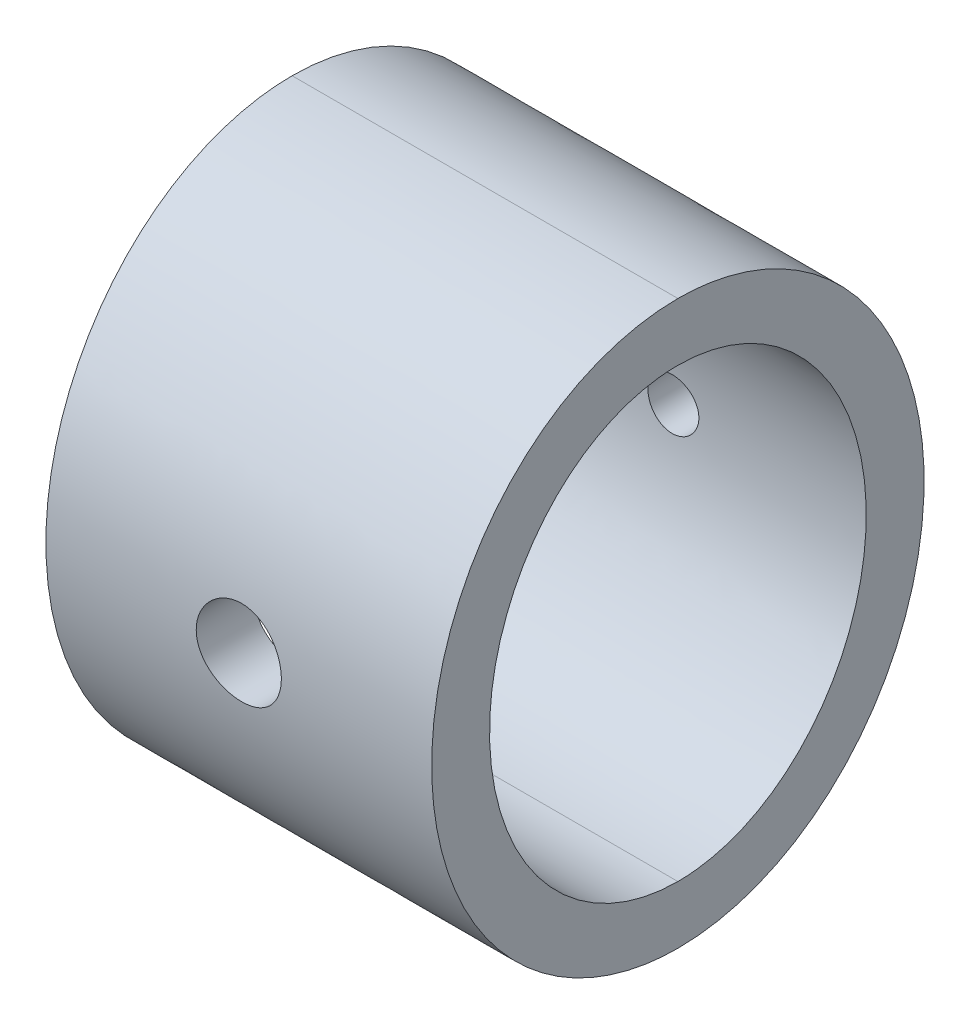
ISO-10303-21;
HEADER;
FILE_DESCRIPTION(('STEP AP214'),'2;1');
FILE_NAME('part.step','',(''),(''),'','','');
FILE_SCHEMA(('AUTOMOTIVE_DESIGN { 1 0 10303 214 1 1 1 1 }'));
ENDSEC;
DATA;
#1=APPLICATION_CONTEXT('core data for automotive mechanical design processes');
#2=APPLICATION_PROTOCOL_DEFINITION('international standard','automotive_design',2000,#1);
#3=PRODUCT_CONTEXT('',#1,'mechanical');
#4=PRODUCT('Part','Part','',(#3));
#5=PRODUCT_RELATED_PRODUCT_CATEGORY('part','',(#4));
#6=PRODUCT_DEFINITION_FORMATION('','',#4);
#7=PRODUCT_DEFINITION_CONTEXT('part definition',#1,'design');
#8=PRODUCT_DEFINITION('design','',#6,#7);
#9=PRODUCT_DEFINITION_SHAPE('','',#8);
#10=(LENGTH_UNIT() NAMED_UNIT(*) SI_UNIT(.MILLI.,.METRE.));
#11=(NAMED_UNIT(*) PLANE_ANGLE_UNIT() SI_UNIT($,.RADIAN.));
#12=(NAMED_UNIT(*) SI_UNIT($,.STERADIAN.) SOLID_ANGLE_UNIT());
#13=UNCERTAINTY_MEASURE_WITH_UNIT(LENGTH_MEASURE(1.E-05),#10,'distance_accuracy_value','');
#14=(GEOMETRIC_REPRESENTATION_CONTEXT(3) GLOBAL_UNCERTAINTY_ASSIGNED_CONTEXT((#13)) GLOBAL_UNIT_ASSIGNED_CONTEXT((#10,
#11,#12)) REPRESENTATION_CONTEXT('',''));
#15=CARTESIAN_POINT('',(0.,0.,0.));
#16=DIRECTION('',(0.,0.,1.));
#17=DIRECTION('',(1.,0.,0.));
#18=AXIS2_PLACEMENT_3D('',#15,#16,#17);
#19=CARTESIAN_POINT('',(0.,0.,55.118));
#20=DIRECTION('',(0.,0.,-1.));
#21=DIRECTION('',(0.,1.,0.));
#22=AXIS2_PLACEMENT_3D('',#19,#20,#21);
#23=CYLINDRICAL_SURFACE('',#22,4.7625);
#24=CARTESIAN_POINT('',(0.,-4.7625,48.2555210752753));
#25=CARTESIAN_POINT('',(0.132750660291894,-4.76249933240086,48.2555213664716));
#26=CARTESIAN_POINT('',(0.265520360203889,-4.75694484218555,48.2564304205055));
#27=CARTESIAN_POINT('',(0.530158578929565,-4.73476311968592,48.2600414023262));
#28=CARTESIAN_POINT('',(0.662026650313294,-4.71813074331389,48.2627441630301));
#29=CARTESIAN_POINT('',(0.924081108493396,-4.67388114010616,48.2698694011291));
#30=CARTESIAN_POINT('',(1.05426443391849,-4.64624620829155,48.2742946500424));
#31=CARTESIAN_POINT('',(1.31185104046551,-4.58018986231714,48.2847370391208));
#32=CARTESIAN_POINT('',(1.43925324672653,-4.54176435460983,48.2907547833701));
#33=CARTESIAN_POINT('',(1.69012670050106,-4.45449076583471,48.3041952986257));
#34=CARTESIAN_POINT('',(1.81360398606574,-4.4056596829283,48.3116157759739));
#35=CARTESIAN_POINT('',(2.05603208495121,-4.29787647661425,48.327657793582));
#36=CARTESIAN_POINT('',(2.1749812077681,-4.23892061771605,48.33627977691));
#37=CARTESIAN_POINT('',(2.40740082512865,-4.11137278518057,48.3544703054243));
#38=CARTESIAN_POINT('',(2.52087540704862,-4.04278815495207,48.3640381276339));
#39=CARTESIAN_POINT('',(2.74171364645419,-3.89640459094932,48.3838600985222));
#40=CARTESIAN_POINT('',(2.84907501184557,-3.81860223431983,48.3941145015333));
#41=CARTESIAN_POINT('',(3.0577492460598,-3.65368344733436,48.4151039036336));
#42=CARTESIAN_POINT('',(3.15900680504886,-3.56649743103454,48.4258420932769));
#43=CARTESIAN_POINT('',(3.35387144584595,-3.38390125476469,48.4474232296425));
#44=CARTESIAN_POINT('',(3.44747569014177,-3.28848807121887,48.4582662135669));
#45=CARTESIAN_POINT('',(3.62632482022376,-3.09014590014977,48.4797464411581));
#46=CARTESIAN_POINT('',(3.71157176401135,-2.98721877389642,48.4903837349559));
#47=CARTESIAN_POINT('',(3.87316670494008,-2.77449688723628,48.5111618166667));
#48=CARTESIAN_POINT('',(3.94951160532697,-2.66469975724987,48.5213024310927));
#49=CARTESIAN_POINT('',(4.09311078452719,-2.43842189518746,48.5408521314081));
#50=CARTESIAN_POINT('',(4.16031435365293,-2.32190860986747,48.5502570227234));
#51=CARTESIAN_POINT('',(4.2846565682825,-2.08355290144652,48.5680090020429));
#52=CARTESIAN_POINT('',(4.34179528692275,-1.96171051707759,48.5763560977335));
#53=CARTESIAN_POINT('',(4.44559047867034,-1.71354136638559,48.5917571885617));
#54=CARTESIAN_POINT('',(4.49224560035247,-1.58721402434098,48.5988110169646));
#55=CARTESIAN_POINT('',(4.57469516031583,-1.33104063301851,48.611421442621));
#56=CARTESIAN_POINT('',(4.61049356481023,-1.20119588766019,48.6169785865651));
#57=CARTESIAN_POINT('',(4.67072692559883,-0.939965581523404,48.626401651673));
#58=CARTESIAN_POINT('',(4.6952531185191,-0.808601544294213,48.6302811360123));
#59=CARTESIAN_POINT('',(4.73317808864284,-0.544287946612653,48.6363048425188));
#60=CARTESIAN_POINT('',(4.74658110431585,-0.411339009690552,48.6384497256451));
#61=CARTESIAN_POINT('',(4.76217365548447,-0.144725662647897,48.6409466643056));
#62=CARTESIAN_POINT('',(4.76435960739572,-0.0110610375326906,48.6412981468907));
#63=CARTESIAN_POINT('',(4.75749253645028,0.255921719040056,48.640197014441));
#64=CARTESIAN_POINT('',(4.74844373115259,0.389239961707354,48.6387450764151));
#65=CARTESIAN_POINT('',(4.71931400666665,0.653443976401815,48.6340998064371));
#66=CARTESIAN_POINT('',(4.69933101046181,0.784340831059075,48.630921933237));
#67=CARTESIAN_POINT('',(4.64856099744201,1.04392064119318,48.6229244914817));
#68=CARTESIAN_POINT('',(4.61777796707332,1.17260439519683,48.6181055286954));
#69=CARTESIAN_POINT('',(4.54562310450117,1.42695437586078,48.6069561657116));
#70=CARTESIAN_POINT('',(4.50424716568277,1.55261941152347,48.6006251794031));
#71=CARTESIAN_POINT('',(4.41123431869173,1.79996390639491,48.58662916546));
#72=CARTESIAN_POINT('',(4.35960104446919,1.9216447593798,48.5789646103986));
#73=CARTESIAN_POINT('',(4.24617763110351,2.16078083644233,48.5624717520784));
#74=CARTESIAN_POINT('',(4.18434205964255,2.27821415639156,48.5536382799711));
#75=CARTESIAN_POINT('',(4.05114288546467,2.50743237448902,48.5350804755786));
#76=CARTESIAN_POINT('',(3.97978149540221,2.6192185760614,48.525356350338));
#77=CARTESIAN_POINT('',(3.82804004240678,2.83637926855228,48.5052854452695));
#78=CARTESIAN_POINT('',(3.74766343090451,2.94175618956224,48.4949389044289));
#79=CARTESIAN_POINT('',(3.57837474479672,3.14550836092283,48.4738969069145));
#80=CARTESIAN_POINT('',(3.48945440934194,3.24387667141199,48.4632011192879));
#81=CARTESIAN_POINT('',(3.20885706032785,3.52933637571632,48.430813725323));
#82=CARTESIAN_POINT('',(3.00487496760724,3.7045914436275,48.4090334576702));
#83=CARTESIAN_POINT('',(2.57019300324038,4.01837703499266,48.3677352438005));
#84=CARTESIAN_POINT('',(2.33949485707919,4.15690992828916,48.3482171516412));
#85=CARTESIAN_POINT('',(1.97818778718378,4.3343188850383,48.3222895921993));
#86=CARTESIAN_POINT('',(1.85498645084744,4.38845611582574,48.3141944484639));
#87=CARTESIAN_POINT('',(1.60444427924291,4.48611227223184,48.2993652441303));
#88=CARTESIAN_POINT('',(1.4771068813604,4.52963977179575,48.2926300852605));
#89=CARTESIAN_POINT('',(1.21935122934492,4.60571674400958,48.2807262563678));
#90=CARTESIAN_POINT('',(1.08893812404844,4.63828333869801,48.2755551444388));
#91=CARTESIAN_POINT('',(0.825795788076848,4.69228036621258,48.2669194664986));
#92=CARTESIAN_POINT('',(0.693067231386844,4.71371398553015,48.2634544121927));
#93=CARTESIAN_POINT('',(0.466831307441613,4.74048736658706,48.2591110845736));
#94=CARTESIAN_POINT('',(0.373666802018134,4.74873884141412,48.2577666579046));
#95=CARTESIAN_POINT('',(0.187004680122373,4.75974539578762,48.255971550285));
#96=CARTESIAN_POINT('',(0.0935070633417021,4.76250047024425,48.2555208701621));
#97=CARTESIAN_POINT('',(-0.132750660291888,4.76249933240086,48.2555213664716));
#98=CARTESIAN_POINT('',(-0.265520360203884,4.75694484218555,48.2564304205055));
#99=CARTESIAN_POINT('',(-0.530158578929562,4.73476311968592,48.2600414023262));
#100=CARTESIAN_POINT('',(-0.662026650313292,4.71813074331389,48.2627441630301));
#101=CARTESIAN_POINT('',(-0.924081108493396,4.67388114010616,48.2698694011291));
#102=CARTESIAN_POINT('',(-1.05426443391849,4.64624620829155,48.2742946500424));
#103=CARTESIAN_POINT('',(-1.31185104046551,4.58018986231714,48.2847370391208));
#104=CARTESIAN_POINT('',(-1.43925324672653,4.54176435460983,48.2907547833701));
#105=CARTESIAN_POINT('',(-1.69012670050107,4.45449076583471,48.3041952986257));
#106=CARTESIAN_POINT('',(-1.81360398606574,4.4056596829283,48.3116157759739));
#107=CARTESIAN_POINT('',(-2.05603208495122,4.29787647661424,48.327657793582));
#108=CARTESIAN_POINT('',(-2.1749812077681,4.23892061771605,48.33627977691));
#109=CARTESIAN_POINT('',(-2.40740082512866,4.11137278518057,48.3544703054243));
#110=CARTESIAN_POINT('',(-2.52087540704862,4.04278815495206,48.3640381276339));
#111=CARTESIAN_POINT('',(-2.74171364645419,3.89640459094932,48.3838600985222));
#112=CARTESIAN_POINT('',(-2.84907501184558,3.81860223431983,48.3941145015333));
#113=CARTESIAN_POINT('',(-3.05774924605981,3.65368344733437,48.4151039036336));
#114=CARTESIAN_POINT('',(-3.15900680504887,3.56649743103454,48.4258420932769));
#115=CARTESIAN_POINT('',(-3.35387144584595,3.38390125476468,48.4474232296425));
#116=CARTESIAN_POINT('',(-3.44747569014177,3.28848807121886,48.4582662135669));
#117=CARTESIAN_POINT('',(-3.62632482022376,3.09014590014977,48.4797464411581));
#118=CARTESIAN_POINT('',(-3.71157176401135,2.98721877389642,48.4903837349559));
#119=CARTESIAN_POINT('',(-3.87316670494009,2.77449688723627,48.5111618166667));
#120=CARTESIAN_POINT('',(-3.94951160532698,2.66469975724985,48.5213024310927));
#121=CARTESIAN_POINT('',(-4.09311078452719,2.43842189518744,48.5408521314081));
#122=CARTESIAN_POINT('',(-4.16031435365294,2.32190860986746,48.5502570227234));
#123=CARTESIAN_POINT('',(-4.2846565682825,2.08355290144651,48.5680090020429));
#124=CARTESIAN_POINT('',(-4.34179528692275,1.96171051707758,48.5763560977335));
#125=CARTESIAN_POINT('',(-4.44559047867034,1.71354136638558,48.5917571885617));
#126=CARTESIAN_POINT('',(-4.49224560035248,1.58721402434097,48.5988110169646));
#127=CARTESIAN_POINT('',(-4.57469516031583,1.3310406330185,48.611421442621));
#128=CARTESIAN_POINT('',(-4.61049356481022,1.20119588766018,48.6169785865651));
#129=CARTESIAN_POINT('',(-4.67072692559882,0.939965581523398,48.626401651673));
#130=CARTESIAN_POINT('',(-4.6952531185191,0.80860154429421,48.6302811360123));
#131=CARTESIAN_POINT('',(-4.73317808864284,0.544287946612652,48.6363048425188));
#132=CARTESIAN_POINT('',(-4.74658110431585,0.411339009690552,48.6384497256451));
#133=CARTESIAN_POINT('',(-4.76217365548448,0.144725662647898,48.6409466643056));
#134=CARTESIAN_POINT('',(-4.76435960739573,0.0110610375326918,48.6412981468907));
#135=CARTESIAN_POINT('',(-4.75749253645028,-0.255921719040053,48.640197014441));
#136=CARTESIAN_POINT('',(-4.74844373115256,-0.38923996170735,48.6387450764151));
#137=CARTESIAN_POINT('',(-4.71931400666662,-0.653443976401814,48.6340998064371));
#138=CARTESIAN_POINT('',(-4.69933101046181,-0.784340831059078,48.6309219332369));
#139=CARTESIAN_POINT('',(-4.64856099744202,-1.04392064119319,48.6229244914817));
#140=CARTESIAN_POINT('',(-4.61777796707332,-1.17260439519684,48.6181055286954));
#141=CARTESIAN_POINT('',(-4.54562310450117,-1.42695437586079,48.6069561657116));
#142=CARTESIAN_POINT('',(-4.50424716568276,-1.55261941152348,48.6006251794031));
#143=CARTESIAN_POINT('',(-4.41123431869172,-1.79996390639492,48.58662916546));
#144=CARTESIAN_POINT('',(-4.35960104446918,-1.92164475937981,48.5789646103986));
#145=CARTESIAN_POINT('',(-4.2461776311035,-2.16078083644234,48.5624717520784));
#146=CARTESIAN_POINT('',(-4.18434205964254,-2.27821415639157,48.5536382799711));
#147=CARTESIAN_POINT('',(-4.05114288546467,-2.50743237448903,48.5350804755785));
#148=CARTESIAN_POINT('',(-3.9797814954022,-2.61921857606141,48.525356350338));
#149=CARTESIAN_POINT('',(-3.82804004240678,-2.83637926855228,48.5052854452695));
#150=CARTESIAN_POINT('',(-3.74766343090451,-2.94175618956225,48.4949389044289));
#151=CARTESIAN_POINT('',(-3.57837474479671,-3.14550836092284,48.4738969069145));
#152=CARTESIAN_POINT('',(-3.48945440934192,-3.24387667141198,48.4632011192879));
#153=CARTESIAN_POINT('',(-3.20885706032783,-3.52933637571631,48.430813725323));
#154=CARTESIAN_POINT('',(-3.00487496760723,-3.70459144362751,48.4090334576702));
#155=CARTESIAN_POINT('',(-2.57019300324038,-4.01837703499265,48.3677352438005));
#156=CARTESIAN_POINT('',(-2.33949485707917,-4.15690992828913,48.3482171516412));
#157=CARTESIAN_POINT('',(-1.97818778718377,-4.33431888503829,48.3222895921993));
#158=CARTESIAN_POINT('',(-1.85498645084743,-4.38845611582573,48.3141944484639));
#159=CARTESIAN_POINT('',(-1.6044442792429,-4.48611227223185,48.2993652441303));
#160=CARTESIAN_POINT('',(-1.47710688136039,-4.52963977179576,48.2926300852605));
#161=CARTESIAN_POINT('',(-1.21935122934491,-4.60571674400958,48.2807262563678));
#162=CARTESIAN_POINT('',(-1.08893812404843,-4.63828333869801,48.2755551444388));
#163=CARTESIAN_POINT('',(-0.825795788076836,-4.69228036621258,48.2669194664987));
#164=CARTESIAN_POINT('',(-0.693067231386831,-4.71371398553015,48.2634544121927));
#165=CARTESIAN_POINT('',(-0.466831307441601,-4.74048736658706,48.2591110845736));
#166=CARTESIAN_POINT('',(-0.373666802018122,-4.74873884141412,48.2577666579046));
#167=CARTESIAN_POINT('',(-0.187004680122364,-4.75974539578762,48.2559715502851));
#168=CARTESIAN_POINT('',(-0.093507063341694,-4.76250047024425,48.2555208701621));
#169=CARTESIAN_POINT('',(0.,-4.7625,48.2555210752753));
#170=B_SPLINE_CURVE_WITH_KNOTS('',3,(#24,#25,#26,#27,#28,#29,#30,#31,#32,#33,#34,#35,#36,#37,
#38,#39,#40,#41,#42,#43,#44,#45,#46,#47,#48,#49,#50,#51,#52,#53,#54,#55,#56,#57,#58,#59,#60,#61,
#62,#63,#64,#65,#66,#67,#68,#69,#70,#71,#72,#73,#74,#75,#76,#77,#78,#79,#80,#81,#82,#83,#84,#85,
#86,#87,#88,#89,#90,#91,#92,#93,#94,#95,#96,#97,#98,#99,#100,#101,#102,#103,#104,#105,#106,#107,
#108,#109,#110,#111,#112,#113,#114,#115,#116,#117,#118,#119,#120,#121,#122,#123,#124,#125,#126,
#127,#128,#129,#130,#131,#132,#133,#134,#135,#136,#137,#138,#139,#140,#141,#142,#143,#144,#145,
#146,#147,#148,#149,#150,#151,#152,#153,#154,#155,#156,#157,#158,#159,#160,#161,#162,#163,#164,
#165,#166,#167,#168,#169),.UNSPECIFIED.,.T.,.F.,(4,2,2,2,2,2,2,2,2,2,2,2,2,2,2,2,2,2,2,2,2,2,2,
2,2,2,2,2,2,2,2,2,2,2,2,2,2,2,2,2,2,2,2,2,2,2,2,2,2,2,2,2,2,2,2,2,2,2,2,2,2,2,2,2,2,2,2,2,2,2,2,
2,4),(0.,0.398165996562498,0.796517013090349,1.19551165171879,1.59465785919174,1.99315696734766,
2.39180341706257,2.79014747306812,3.18863991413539,3.59032289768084,3.99215413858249,
4.39388617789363,4.79575755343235,5.19977446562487,5.6037884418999,6.00785446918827,
6.41177270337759,6.81236143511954,7.21279745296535,7.61336139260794,8.0137750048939,
8.4106599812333,8.80739861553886,9.20429128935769,9.60104360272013,9.99961291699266,
10.3980898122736,10.7964146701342,11.1951286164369,12.0005004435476,12.8058202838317,
13.2098552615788,13.6135626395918,14.0166364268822,14.4195947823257,14.7000551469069,
14.9805157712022,15.3786817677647,15.7770327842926,16.176027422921,16.575173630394,
16.9736727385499,17.3723191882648,17.7706632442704,18.1691556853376,18.5708386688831,
18.9726699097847,19.3744019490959,19.7762733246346,20.1802902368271,20.5843042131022,
20.9883702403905,21.3922884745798,21.7928772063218,22.1933132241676,22.5938771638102,
22.9942907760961,23.3911757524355,23.7879143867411,24.1848070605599,24.5815593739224,
24.9801286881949,25.3786055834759,25.7769304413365,26.1756443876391,26.9810162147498,
27.7863360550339,28.190371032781,28.5940784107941,28.9971521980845,29.400110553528,
29.6805709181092,29.9610315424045),.UNSPECIFIED.);
#171=CARTESIAN_POINT('',(0.,-4.7625,48.2555210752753));
#172=VERTEX_POINT('',#171);
#173=EDGE_CURVE('E18',#172,#172,#170,.T.);
#174=ORIENTED_EDGE('',*,*,#173,.F.);
#175=EDGE_LOOP('',(#174));
#176=FACE_BOUND('',#175,.T.);
#177=CARTESIAN_POINT('',(0.,4.7625,54.8011186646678));
#178=CARTESIAN_POINT('',(-0.133058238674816,4.76249930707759,54.8011189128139));
#179=CARTESIAN_POINT('',(-0.266137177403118,4.75691908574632,54.8018670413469));
#180=CARTESIAN_POINT('',(-0.531395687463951,4.73463328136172,54.8048391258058));
#181=CARTESIAN_POINT('',(-0.66357480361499,4.7179224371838,54.8070637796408));
#182=CARTESIAN_POINT('',(-0.926257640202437,4.67345966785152,54.8129296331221));
#183=CARTESIAN_POINT('',(-1.05675824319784,4.64568960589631,54.8165731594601));
#184=CARTESIAN_POINT('',(-1.31497804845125,4.57930318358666,54.8251726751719));
#185=CARTESIAN_POINT('',(-1.44269617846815,4.54068271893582,54.8301291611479));
#186=CARTESIAN_POINT('',(-1.69421085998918,4.45295054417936,54.8412026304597));
#187=CARTESIAN_POINT('',(-1.81801295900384,4.40385451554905,54.8473178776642));
#188=CARTESIAN_POINT('',(-2.06107332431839,4.29547388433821,54.8605412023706));
#189=CARTESIAN_POINT('',(-2.18032989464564,4.23618552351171,54.8676496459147));
#190=CARTESIAN_POINT('',(-2.4133315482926,4.1079081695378,54.8826496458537));
#191=CARTESIAN_POINT('',(-2.52708088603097,4.038926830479,54.8905405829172));
#192=CARTESIAN_POINT('',(-2.7484259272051,3.8916880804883,54.9068906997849));
#193=CARTESIAN_POINT('',(-2.85601932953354,3.81342723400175,54.9153500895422));
#194=CARTESIAN_POINT('',(-3.06482610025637,3.64775329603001,54.9326433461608));
#195=CARTESIAN_POINT('',(-3.16600222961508,3.56029345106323,54.9414789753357));
#196=CARTESIAN_POINT('',(-3.3606759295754,3.37714823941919,54.9592359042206));
#197=CARTESIAN_POINT('',(-3.45417065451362,3.28145985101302,54.9681572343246));
#198=CARTESIAN_POINT('',(-3.63276613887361,3.0825759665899,54.9858289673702));
#199=CARTESIAN_POINT('',(-3.71786903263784,2.97938239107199,54.9945794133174));
#200=CARTESIAN_POINT('',(-3.8791391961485,2.76614551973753,55.0116689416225));
#201=CARTESIAN_POINT('',(-3.95530335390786,2.65609985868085,55.0200078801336));
#202=CARTESIAN_POINT('',(-4.09837453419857,2.42955621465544,55.0360652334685));
#203=CARTESIAN_POINT('',(-4.16524789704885,2.3130368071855,55.0437813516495));
#204=CARTESIAN_POINT('',(-4.28893374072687,2.07472319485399,55.0583415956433));
#205=CARTESIAN_POINT('',(-4.34574627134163,1.95292901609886,55.065185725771));
#206=CARTESIAN_POINT('',(-4.4489017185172,1.70491074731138,55.077808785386));
#207=CARTESIAN_POINT('',(-4.49524316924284,1.57868603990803,55.0835875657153));
#208=CARTESIAN_POINT('',(-4.5770870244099,1.32277046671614,55.0939125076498));
#209=CARTESIAN_POINT('',(-4.61259332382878,1.19308086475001,55.0984591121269));
#210=CARTESIAN_POINT('',(-4.6723570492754,0.931847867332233,55.1061715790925));
#211=CARTESIAN_POINT('',(-4.69667539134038,0.800318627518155,55.1093449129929));
#212=CARTESIAN_POINT('',(-4.73416063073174,0.53570417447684,55.1142565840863));
#213=CARTESIAN_POINT('',(-4.74733172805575,0.402619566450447,55.1159954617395));
#214=CARTESIAN_POINT('',(-4.76244083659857,0.135758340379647,55.1179913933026));
#215=CARTESIAN_POINT('',(-4.76437508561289,0.00198150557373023,55.1182479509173));
#216=CARTESIAN_POINT('',(-4.75698711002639,-0.265205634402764,55.1172708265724));
#217=CARTESIAN_POINT('',(-4.74766908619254,-0.398616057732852,55.1160377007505));
#218=CARTESIAN_POINT('',(-4.71794219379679,-0.663376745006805,55.1121286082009));
#219=CARTESIAN_POINT('',(-4.69759901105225,-0.794734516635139,55.1094611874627));
#220=CARTESIAN_POINT('',(-4.64602624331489,-1.05520929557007,55.102764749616));
#221=CARTESIAN_POINT('',(-4.6148006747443,-1.18432711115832,55.0987362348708));
#222=CARTESIAN_POINT('',(-4.54167756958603,-1.4395119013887,55.0894276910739));
#223=CARTESIAN_POINT('',(-4.49977591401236,-1.56557767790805,55.0841471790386));
#224=CARTESIAN_POINT('',(-4.40562915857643,-1.81368045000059,55.0724843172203));
#225=CARTESIAN_POINT('',(-4.35338776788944,-1.93571887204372,55.0661023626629));
#226=CARTESIAN_POINT('',(-4.2387367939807,-2.17536622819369,55.0523892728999));
#227=CARTESIAN_POINT('',(-4.17629404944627,-2.29295912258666,55.0450550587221));
#228=CARTESIAN_POINT('',(-4.04182782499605,-2.52244302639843,55.0296600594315));
#229=CARTESIAN_POINT('',(-3.96980656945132,-2.63433535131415,55.0215994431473));
#230=CARTESIAN_POINT('',(-3.81670092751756,-2.85164004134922,55.0049766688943));
#231=CARTESIAN_POINT('',(-3.73562021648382,-2.95705500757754,54.9964147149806));
#232=CARTESIAN_POINT('',(-3.56488724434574,-3.16080539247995,54.9790182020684));
#233=CARTESIAN_POINT('',(-3.47522671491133,-3.25913381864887,54.9701833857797));
#234=CARTESIAN_POINT('',(-3.19303205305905,-3.54365858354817,54.943522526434));
#235=CARTESIAN_POINT('',(-2.98827221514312,-3.71799406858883,54.9256519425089));
#236=CARTESIAN_POINT('',(-2.55224749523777,-4.02979699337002,54.8918433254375));
#237=CARTESIAN_POINT('',(-2.32098412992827,-4.16726654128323,54.8759051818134));
#238=CARTESIAN_POINT('',(-1.95910065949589,-4.34297592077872,54.8547934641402));
#239=CARTESIAN_POINT('',(-1.83578519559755,-4.39651857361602,54.8482146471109));
#240=CARTESIAN_POINT('',(-1.58509285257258,-4.49298188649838,54.8361831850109));
#241=CARTESIAN_POINT('',(-1.45771934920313,-4.53591112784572,54.8307296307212));
#242=CARTESIAN_POINT('',(-1.19996911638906,-4.61079959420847,54.8211127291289));
#243=CARTESIAN_POINT('',(-1.06959743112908,-4.64277598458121,54.8169473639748));
#244=CARTESIAN_POINT('',(-0.80660862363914,-4.6956112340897,54.8100173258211));
#245=CARTESIAN_POINT('',(-0.673992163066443,-4.71647331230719,54.8072522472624));
#246=CARTESIAN_POINT('',(-0.451008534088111,-4.74195741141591,54.803863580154));
#247=CARTESIAN_POINT('',(-0.36098732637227,-4.74965805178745,54.8028355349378));
#248=CARTESIAN_POINT('',(-0.180647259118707,-4.7599295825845,54.8014629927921));
#249=CARTESIAN_POINT('',(-0.0903283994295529,-4.76250047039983,54.8011184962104));
#250=CARTESIAN_POINT('',(0.133058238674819,-4.76249930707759,54.8011189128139));
#251=CARTESIAN_POINT('',(0.266137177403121,-4.75691908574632,54.8018670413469));
#252=CARTESIAN_POINT('',(0.531395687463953,-4.73463328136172,54.8048391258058));
#253=CARTESIAN_POINT('',(0.663574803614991,-4.7179224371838,54.8070637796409));
#254=CARTESIAN_POINT('',(0.926257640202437,-4.67345966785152,54.8129296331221));
#255=CARTESIAN_POINT('',(1.05675824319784,-4.64568960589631,54.8165731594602));
#256=CARTESIAN_POINT('',(1.31497804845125,-4.57930318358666,54.8251726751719));
#257=CARTESIAN_POINT('',(1.44269617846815,-4.54068271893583,54.8301291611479));
#258=CARTESIAN_POINT('',(1.69421085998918,-4.45295054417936,54.8412026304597));
#259=CARTESIAN_POINT('',(1.81801295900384,-4.40385451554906,54.8473178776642));
#260=CARTESIAN_POINT('',(2.06107332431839,-4.29547388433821,54.8605412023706));
#261=CARTESIAN_POINT('',(2.18032989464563,-4.23618552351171,54.8676496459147));
#262=CARTESIAN_POINT('',(2.4133315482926,-4.1079081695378,54.8826496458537));
#263=CARTESIAN_POINT('',(2.52708088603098,-4.038926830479,54.8905405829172));
#264=CARTESIAN_POINT('',(2.7484259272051,-3.8916880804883,54.9068906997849));
#265=CARTESIAN_POINT('',(2.85601932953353,-3.81342723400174,54.9153500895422));
#266=CARTESIAN_POINT('',(3.06482610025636,-3.64775329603,54.9326433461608));
#267=CARTESIAN_POINT('',(3.16600222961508,-3.56029345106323,54.9414789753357));
#268=CARTESIAN_POINT('',(3.3606759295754,-3.37714823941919,54.9592359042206));
#269=CARTESIAN_POINT('',(3.45417065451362,-3.28145985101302,54.9681572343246));
#270=CARTESIAN_POINT('',(3.63276613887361,-3.0825759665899,54.9858289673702));
#271=CARTESIAN_POINT('',(3.71786903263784,-2.97938239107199,54.9945794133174));
#272=CARTESIAN_POINT('',(3.8791391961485,-2.76614551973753,55.0116689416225));
#273=CARTESIAN_POINT('',(3.95530335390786,-2.65609985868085,55.0200078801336));
#274=CARTESIAN_POINT('',(4.09837453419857,-2.42955621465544,55.0360652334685));
#275=CARTESIAN_POINT('',(4.16524789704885,-2.3130368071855,55.0437813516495));
#276=CARTESIAN_POINT('',(4.28893374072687,-2.07472319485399,55.0583415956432));
#277=CARTESIAN_POINT('',(4.34574627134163,-1.95292901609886,55.065185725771));
#278=CARTESIAN_POINT('',(4.4489017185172,-1.70491074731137,55.077808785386));
#279=CARTESIAN_POINT('',(4.49524316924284,-1.57868603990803,55.0835875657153));
#280=CARTESIAN_POINT('',(4.5770870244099,-1.32277046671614,55.0939125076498));
#281=CARTESIAN_POINT('',(4.61259332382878,-1.19308086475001,55.0984591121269));
#282=CARTESIAN_POINT('',(4.6723570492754,-0.931847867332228,55.1061715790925));
#283=CARTESIAN_POINT('',(4.69667539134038,-0.800318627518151,55.1093449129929));
#284=CARTESIAN_POINT('',(4.73416063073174,-0.535704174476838,55.1142565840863));
#285=CARTESIAN_POINT('',(4.74733172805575,-0.402619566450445,55.1159954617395));
#286=CARTESIAN_POINT('',(4.76244083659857,-0.135758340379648,55.1179913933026));
#287=CARTESIAN_POINT('',(4.76437508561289,-0.00198150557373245,55.1182479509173));
#288=CARTESIAN_POINT('',(4.75698711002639,0.265205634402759,55.1172708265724));
#289=CARTESIAN_POINT('',(4.74766908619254,0.398616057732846,55.1160377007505));
#290=CARTESIAN_POINT('',(4.71794219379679,0.663376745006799,55.1121286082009));
#291=CARTESIAN_POINT('',(4.69759901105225,0.794734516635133,55.1094611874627));
#292=CARTESIAN_POINT('',(4.64602624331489,1.05520929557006,55.102764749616));
#293=CARTESIAN_POINT('',(4.6148006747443,1.18432711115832,55.0987362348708));
#294=CARTESIAN_POINT('',(4.54167756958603,1.4395119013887,55.0894276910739));
#295=CARTESIAN_POINT('',(4.49977591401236,1.56557767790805,55.0841471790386));
#296=CARTESIAN_POINT('',(4.40562915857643,1.81368045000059,55.0724843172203));
#297=CARTESIAN_POINT('',(4.35338776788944,1.93571887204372,55.0661023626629));
#298=CARTESIAN_POINT('',(4.2387367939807,2.17536622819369,55.0523892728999));
#299=CARTESIAN_POINT('',(4.17629404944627,2.29295912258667,55.0450550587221));
#300=CARTESIAN_POINT('',(4.04182782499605,2.52244302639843,55.0296600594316));
#301=CARTESIAN_POINT('',(3.96980656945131,2.63433535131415,55.0215994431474));
#302=CARTESIAN_POINT('',(3.81670092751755,2.85164004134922,55.0049766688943));
#303=CARTESIAN_POINT('',(3.73562021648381,2.95705500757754,54.9964147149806));
#304=CARTESIAN_POINT('',(3.56488724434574,3.16080539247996,54.9790182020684));
#305=CARTESIAN_POINT('',(3.47522671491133,3.25913381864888,54.9701833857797));
#306=CARTESIAN_POINT('',(3.19303205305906,3.54365858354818,54.9435225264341));
#307=CARTESIAN_POINT('',(2.98827221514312,3.71799406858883,54.9256519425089));
#308=CARTESIAN_POINT('',(2.55224749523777,4.02979699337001,54.8918433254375));
#309=CARTESIAN_POINT('',(2.32098412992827,4.16726654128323,54.8759051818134));
#310=CARTESIAN_POINT('',(1.95910065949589,4.34297592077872,54.8547934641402));
#311=CARTESIAN_POINT('',(1.83578519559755,4.39651857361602,54.848214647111));
#312=CARTESIAN_POINT('',(1.58509285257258,4.49298188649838,54.8361831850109));
#313=CARTESIAN_POINT('',(1.45771934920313,4.53591112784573,54.8307296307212));
#314=CARTESIAN_POINT('',(1.19996911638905,4.61079959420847,54.8211127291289));
#315=CARTESIAN_POINT('',(1.06959743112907,4.64277598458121,54.8169473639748));
#316=CARTESIAN_POINT('',(0.806608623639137,4.69561123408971,54.8100173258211));
#317=CARTESIAN_POINT('',(0.673992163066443,4.71647331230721,54.8072522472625));
#318=CARTESIAN_POINT('',(0.451008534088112,4.74195741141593,54.803863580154));
#319=CARTESIAN_POINT('',(0.360987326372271,4.74965805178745,54.8028355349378));
#320=CARTESIAN_POINT('',(0.180647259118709,4.75992958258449,54.8014629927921));
#321=CARTESIAN_POINT('',(0.0903283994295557,4.76250047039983,54.8011184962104));
#322=CARTESIAN_POINT('',(0.,4.7625,54.8011186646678));
#323=B_SPLINE_CURVE_WITH_KNOTS('',3,(#177,#178,#179,#180,#181,#182,#183,#184,#185,#186,#187,
#188,#189,#190,#191,#192,#193,#194,#195,#196,#197,#198,#199,#200,#201,#202,#203,#204,#205,#206,
#207,#208,#209,#210,#211,#212,#213,#214,#215,#216,#217,#218,#219,#220,#221,#222,#223,#224,#225,
#226,#227,#228,#229,#230,#231,#232,#233,#234,#235,#236,#237,#238,#239,#240,#241,#242,#243,#244,
#245,#246,#247,#248,#249,#250,#251,#252,#253,#254,#255,#256,#257,#258,#259,#260,#261,#262,#263,
#264,#265,#266,#267,#268,#269,#270,#271,#272,#273,#274,#275,#276,#277,#278,#279,#280,#281,#282,
#283,#284,#285,#286,#287,#288,#289,#290,#291,#292,#293,#294,#295,#296,#297,#298,#299,#300,#301,
#302,#303,#304,#305,#306,#307,#308,#309,#310,#311,#312,#313,#314,#315,#316,#317,#318,#319,#320,
#321,#322),.UNSPECIFIED.,.T.,.F.,(4,2,2,2,2,2,2,2,2,2,2,2,2,2,2,2,2,2,2,2,2,2,2,2,2,2,2,2,2,2,2,
2,2,2,2,2,2,2,2,2,2,2,2,2,2,2,2,2,2,2,2,2,2,2,2,2,2,2,2,2,2,2,2,2,2,2,2,2,2,2,2,2,4),(0.,
0.399091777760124,0.798372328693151,1.1983104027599,1.59839996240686,1.99789475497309,
2.39753717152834,2.79686576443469,3.19634266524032,3.59795816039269,3.99972177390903,
4.40138293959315,4.80318352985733,5.20640382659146,5.60962212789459,6.01289684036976,
6.41602641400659,6.81693427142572,7.21769100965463,7.61858191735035,8.01932320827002,
8.41770279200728,8.81593549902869,9.21432208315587,9.61256601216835,10.0121312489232,
10.4116038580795,10.8109149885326,11.2106148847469,12.0151011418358,12.819541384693,
13.222932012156,13.625995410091,14.0284242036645,14.4307363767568,14.7016651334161,
14.9725940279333,15.3716858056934,15.7709663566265,16.1709044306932,16.5709939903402,
16.9704887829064,17.3701311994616,17.769459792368,18.1689366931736,18.570552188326,
18.9723158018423,19.3739769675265,19.7757775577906,20.1789978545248,20.5822161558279,
20.9854908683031,21.3886204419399,21.789528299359,22.1902850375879,22.5911759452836,
22.9919172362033,23.3902968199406,23.788529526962,24.1869161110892,24.5851600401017,
24.9847252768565,25.3841978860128,25.7835090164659,26.1832089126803,26.9876951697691,
27.7921354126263,28.1955260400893,28.5985894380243,29.0010182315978,29.4033304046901,
29.6742591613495,29.9451880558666),.UNSPECIFIED.);
#324=CARTESIAN_POINT('',(0.,4.7625,54.8011186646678));
#325=VERTEX_POINT('',#324);
#326=EDGE_CURVE('E119',#325,#325,#323,.T.);
#327=ORIENTED_EDGE('',*,*,#326,.T.);
#328=EDGE_LOOP('',(#327));
#329=FACE_BOUND('',#328,.T.);
#330=ADVANCED_FACE('F14',(#176,#329),#23,.F.);
#331=CARTESIAN_POINT('',(21.59,25.019,27.559));
#332=CARTESIAN_POINT('',(-21.59,25.019,27.559));
#333=CARTESIAN_POINT('',(21.59,25.019,69.723));
#334=CARTESIAN_POINT('',(-21.59,25.019,69.723));
#335=CARTESIAN_POINT('',(21.59,-25.019,69.723));
#336=CARTESIAN_POINT('',(-21.59,-25.019,69.723));
#337=CARTESIAN_POINT('',(21.59,-25.019,27.559));
#338=CARTESIAN_POINT('',(-21.59,-25.019,27.559));
#339=(BOUNDED_SURFACE() B_SPLINE_SURFACE(3,1,((#331,#332),(#333,#334),(#335,#336),(#337,#338)),
.UNSPECIFIED.,.F.,.F.,.F.) B_SPLINE_SURFACE_WITH_KNOTS((4,4),(2,2),(0.,1.),(0.,1.),
.UNSPECIFIED.) GEOMETRIC_REPRESENTATION_ITEM() RATIONAL_B_SPLINE_SURFACE(((1.,1.),
(0.333333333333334,0.333333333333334),(0.333333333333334,0.333333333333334),(1.,1.))) REPRESENTATION_ITEM('') SURFACE());
#340=CARTESIAN_POINT('',(21.59,-25.019,27.559));
#341=CARTESIAN_POINT('',(21.59,-25.019022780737,27.905086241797));
#342=CARTESIAN_POINT('',(21.59,-25.0088872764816,28.2511666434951));
#343=CARTESIAN_POINT('',(21.59,-24.9684719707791,28.942021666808));
#344=CARTESIAN_POINT('',(21.59,-24.9381996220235,29.2867967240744));
#345=CARTESIAN_POINT('',(21.59,-24.8576876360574,29.9739623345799));
#346=CARTESIAN_POINT('',(21.59,-24.8074504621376,30.3163531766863));
#347=CARTESIAN_POINT('',(21.59,-24.6876047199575,30.996105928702));
#348=CARTESIAN_POINT('',(21.59,-24.6180859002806,31.3334836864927));
#349=CARTESIAN_POINT('',(21.59,-24.4599910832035,32.0037649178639));
#350=CARTESIAN_POINT('',(21.59,-24.3714140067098,32.3366681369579));
#351=CARTESIAN_POINT('',(21.59,-24.1757323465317,32.996960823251));
#352=CARTESIAN_POINT('',(21.59,-24.0686277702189,33.3243502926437));
#353=CARTESIAN_POINT('',(21.59,-23.7786580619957,34.1341811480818));
#354=CARTESIAN_POINT('',(21.59,-23.5846234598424,34.6126615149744));
#355=CARTESIAN_POINT('',(21.59,-23.1585440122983,35.5524785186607));
#356=CARTESIAN_POINT('',(21.59,-22.9264915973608,36.0138117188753));
#357=CARTESIAN_POINT('',(21.59,-22.5518036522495,36.6912117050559));
#358=CARTESIAN_POINT('',(21.59,-22.4223969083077,36.9146933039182));
#359=CARTESIAN_POINT('',(21.59,-22.1550908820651,37.3564328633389));
#360=CARTESIAN_POINT('',(21.59,-22.0171940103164,37.574692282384));
#361=CARTESIAN_POINT('',(21.59,-21.5911811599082,38.2214253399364));
#362=CARTESIAN_POINT('',(21.59,-21.2907411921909,38.6418569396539));
#363=CARTESIAN_POINT('',(21.59,-20.6374823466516,39.4884932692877));
#364=CARTESIAN_POINT('',(21.59,-20.2824597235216,39.9129920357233));
#365=CARTESIAN_POINT('',(21.59,-19.5413206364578,40.7339000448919));
#366=CARTESIAN_POINT('',(21.59,-19.1552029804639,41.1303082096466));
#367=CARTESIAN_POINT('',(21.59,-18.3550361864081,41.8939942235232));
#368=CARTESIAN_POINT('',(21.59,-17.9409805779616,42.2612652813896));
#369=CARTESIAN_POINT('',(21.59,-17.0880781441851,42.9658226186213));
#370=CARTESIAN_POINT('',(21.59,-16.6492285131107,43.3031054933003));
#371=CARTESIAN_POINT('',(21.59,-15.6830801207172,43.9948017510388));
#372=CARTESIAN_POINT('',(21.59,-15.1523033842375,44.3443627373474));
#373=CARTESIAN_POINT('',(21.59,-14.0660667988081,45.0027350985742));
#374=CARTESIAN_POINT('',(21.59,-13.5106049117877,45.311543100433));
#375=CARTESIAN_POINT('',(21.59,-12.3785967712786,45.8882673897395));
#376=CARTESIAN_POINT('',(21.59,-11.8020422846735,46.1561674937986));
#377=CARTESIAN_POINT('',(21.59,-10.6315779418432,46.6508524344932));
#378=CARTESIAN_POINT('',(21.59,-10.0376673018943,46.8776354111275));
#379=CARTESIAN_POINT('',(21.59,-8.74245227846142,47.3221186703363));
#380=CARTESIAN_POINT('',(21.59,-8.03878355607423,47.5329492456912));
#381=CARTESIAN_POINT('',(21.59,-6.61729294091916,47.8998814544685));
#382=CARTESIAN_POINT('',(21.59,-5.89946944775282,48.0559768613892));
#383=CARTESIAN_POINT('',(21.59,-4.4537847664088,48.3136126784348));
#384=CARTESIAN_POINT('',(21.59,-3.72591930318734,48.4151290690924));
#385=CARTESIAN_POINT('',(21.59,-2.26464470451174,48.5636131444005));
#386=CARTESIAN_POINT('',(21.59,-1.53123537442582,48.6105789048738));
#387=CARTESIAN_POINT('',(21.59,0.0172125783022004,48.6521700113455));
#388=CARTESIAN_POINT('',(21.59,0.83242395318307,48.6405233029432));
#389=CARTESIAN_POINT('',(21.59,2.45923228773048,48.5501471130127));
#390=CARTESIAN_POINT('',(21.59,3.2708291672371,48.4714161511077));
#391=CARTESIAN_POINT('',(21.59,4.48146009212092,48.3029058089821));
#392=CARTESIAN_POINT('',(21.59,4.88413117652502,48.2382759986));
#393=CARTESIAN_POINT('',(21.59,5.68630239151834,48.0921866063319));
#394=CARTESIAN_POINT('',(21.59,6.08580329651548,48.0107312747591));
#395=CARTESIAN_POINT('',(21.59,7.27826112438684,47.741130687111));
#396=CARTESIAN_POINT('',(21.59,8.06566431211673,47.5276827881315));
#397=CARTESIAN_POINT('',(21.59,9.62824092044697,47.0302365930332));
#398=CARTESIAN_POINT('',(21.59,10.4031541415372,46.7454223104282));
#399=CARTESIAN_POINT('',(21.59,11.924064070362,46.1064338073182));
#400=CARTESIAN_POINT('',(21.59,12.670057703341,45.7522522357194));
#401=CARTESIAN_POINT('',(21.59,14.1241835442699,44.9753229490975));
#402=CARTESIAN_POINT('',(21.59,14.8323673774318,44.5526720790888));
#403=CARTESIAN_POINT('',(21.59,16.2032551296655,43.6392441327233));
#404=CARTESIAN_POINT('',(21.59,16.8659762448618,43.1484930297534));
#405=CARTESIAN_POINT('',(21.59,17.9644600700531,42.2424396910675));
#406=CARTESIAN_POINT('',(21.59,18.4131017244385,41.84266844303));
#407=CARTESIAN_POINT('',(21.59,19.2772481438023,41.0087880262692));
#408=CARTESIAN_POINT('',(21.59,19.6927584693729,40.5746846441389));
#409=CARTESIAN_POINT('',(21.59,20.4864262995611,39.673684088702));
#410=CARTESIAN_POINT('',(21.59,20.864590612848,39.2067929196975));
#411=CARTESIAN_POINT('',(21.59,21.5794066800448,38.2420869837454));
#412=CARTESIAN_POINT('',(21.59,21.9160580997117,37.7442719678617));
#413=CARTESIAN_POINT('',(21.59,22.4404351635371,36.8886704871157));
#414=CARTESIAN_POINT('',(21.59,22.640773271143,36.5385553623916));
#415=CARTESIAN_POINT('',(21.59,23.0195198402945,35.8265929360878));
#416=CARTESIAN_POINT('',(21.59,23.1979271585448,35.4647450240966));
#417=CARTESIAN_POINT('',(21.59,23.5315947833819,34.7304586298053));
#418=CARTESIAN_POINT('',(21.59,23.6868515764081,34.3580185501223));
#419=CARTESIAN_POINT('',(21.59,23.9728186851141,33.6045641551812));
#420=CARTESIAN_POINT('',(21.59,24.1035716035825,33.2235660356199));
#421=CARTESIAN_POINT('',(21.59,24.339854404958,32.4538855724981));
#422=CARTESIAN_POINT('',(21.59,24.4453879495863,32.0652043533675));
#423=CARTESIAN_POINT('',(21.59,24.6303598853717,31.2819130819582));
#424=CARTESIAN_POINT('',(21.59,24.7098151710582,30.8873070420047));
#425=CARTESIAN_POINT('',(21.59,24.8163090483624,30.2482645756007));
#426=CARTESIAN_POINT('',(21.59,24.8517104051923,30.0051921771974));
#427=CARTESIAN_POINT('',(21.59,24.9124604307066,29.5178665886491));
#428=CARTESIAN_POINT('',(21.59,24.9378121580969,29.2736137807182));
#429=CARTESIAN_POINT('',(21.59,24.9986593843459,28.5401587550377));
#430=CARTESIAN_POINT('',(21.59,25.0190461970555,28.0496643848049));
#431=CARTESIAN_POINT('',(21.59,25.019,27.559));
#432=B_SPLINE_CURVE_WITH_KNOTS('',3,(#340,#341,#342,#343,#344,#345,#346,#347,#348,#349,#350,
#351,#352,#353,#354,#355,#356,#357,#358,#359,#360,#361,#362,#363,#364,#365,#366,#367,#368,#369,
#370,#371,#372,#373,#374,#375,#376,#377,#378,#379,#380,#381,#382,#383,#384,#385,#386,#387,#388,
#389,#390,#391,#392,#393,#394,#395,#396,#397,#398,#399,#400,#401,#402,#403,#404,#405,#406,#407,
#408,#409,#410,#411,#412,#413,#414,#415,#416,#417,#418,#419,#420,#421,#422,#423,#424,#425,#426,
#427,#428,#429,#430,#431),.UNSPECIFIED.,.F.,.F.,(4,2,2,2,2,2,2,2,2,2,2,2,2,2,2,2,2,2,2,2,2,2,2,
2,2,2,2,2,2,2,2,2,2,2,2,2,2,2,2,2,2,2,2,2,2,4),(0.,1.03810104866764,2.07581810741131,
3.11340717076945,4.14624544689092,5.17914221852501,6.21203857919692,7.75921449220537,
9.30669883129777,10.0812649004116,10.855612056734,12.4042955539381,14.0628338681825,
15.7214357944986,17.3804231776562,19.0395986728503,20.9443294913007,22.8492178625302,
24.7548578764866,26.6605840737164,28.8620200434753,31.0637063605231,33.2663608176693,
35.469092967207,37.912237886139,40.3554367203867,41.5785985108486,42.801451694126,
45.2456753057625,47.7192340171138,50.1930550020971,52.663407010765,55.1328194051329,
56.9338462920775,58.7345702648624,60.5349653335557,62.335374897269,63.5448278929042,
64.7543439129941,65.9640433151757,67.1716195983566,68.3790204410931,69.5856375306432,
70.3223593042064,71.0588566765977,72.5300460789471),.UNSPECIFIED.);
#433=CARTESIAN_POINT('',(21.59,-25.019,27.559));
#434=VERTEX_POINT('',#433);
#435=CARTESIAN_POINT('',(21.59,25.019,27.559));
#436=VERTEX_POINT('',#435);
#437=EDGE_CURVE('E111',#434,#436,#432,.T.);
#438=DIRECTION('',(1.,0.,0.));
#439=VECTOR('',#438,1.);
#440=CARTESIAN_POINT('',(0.,-25.019,27.559));
#441=LINE('',#440,#439);
#442=CARTESIAN_POINT('',(-21.59,-25.019,27.559));
#443=VERTEX_POINT('',#442);
#444=EDGE_CURVE('E69',#443,#434,#441,.T.);
#445=CARTESIAN_POINT('',(-21.59,-25.019,27.559));
#446=CARTESIAN_POINT('',(-21.59,-25.019022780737,27.905086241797));
#447=CARTESIAN_POINT('',(-21.59,-25.0088872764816,28.2511666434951));
#448=CARTESIAN_POINT('',(-21.59,-24.9684719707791,28.942021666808));
#449=CARTESIAN_POINT('',(-21.59,-24.9381996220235,29.2867967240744));
#450=CARTESIAN_POINT('',(-21.59,-24.8576876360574,29.9739623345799));
#451=CARTESIAN_POINT('',(-21.59,-24.8074504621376,30.3163531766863));
#452=CARTESIAN_POINT('',(-21.59,-24.6876047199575,30.996105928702));
#453=CARTESIAN_POINT('',(-21.59,-24.6180859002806,31.3334836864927));
#454=CARTESIAN_POINT('',(-21.59,-24.4599910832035,32.0037649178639));
#455=CARTESIAN_POINT('',(-21.59,-24.3714140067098,32.3366681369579));
#456=CARTESIAN_POINT('',(-21.59,-24.1757323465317,32.996960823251));
#457=CARTESIAN_POINT('',(-21.59,-24.0686277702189,33.3243502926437));
#458=CARTESIAN_POINT('',(-21.59,-23.7786580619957,34.1341811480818));
#459=CARTESIAN_POINT('',(-21.59,-23.5846234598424,34.6126615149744));
#460=CARTESIAN_POINT('',(-21.59,-23.1585440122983,35.5524785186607));
#461=CARTESIAN_POINT('',(-21.59,-22.9264915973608,36.0138117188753));
#462=CARTESIAN_POINT('',(-21.59,-22.5518036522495,36.6912117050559));
#463=CARTESIAN_POINT('',(-21.59,-22.4223969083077,36.9146933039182));
#464=CARTESIAN_POINT('',(-21.59,-22.1550908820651,37.3564328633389));
#465=CARTESIAN_POINT('',(-21.59,-22.0171940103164,37.574692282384));
#466=CARTESIAN_POINT('',(-21.59,-21.5911811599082,38.2214253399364));
#467=CARTESIAN_POINT('',(-21.59,-21.2907411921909,38.6418569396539));
#468=CARTESIAN_POINT('',(-21.59,-20.6374823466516,39.4884932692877));
#469=CARTESIAN_POINT('',(-21.59,-20.2824597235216,39.9129920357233));
#470=CARTESIAN_POINT('',(-21.59,-19.5413206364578,40.7339000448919));
#471=CARTESIAN_POINT('',(-21.59,-19.1552029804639,41.1303082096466));
#472=CARTESIAN_POINT('',(-21.59,-18.3550361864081,41.8939942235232));
#473=CARTESIAN_POINT('',(-21.59,-17.9409805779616,42.2612652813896));
#474=CARTESIAN_POINT('',(-21.59,-17.0880781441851,42.9658226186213));
#475=CARTESIAN_POINT('',(-21.59,-16.6492285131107,43.3031054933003));
#476=CARTESIAN_POINT('',(-21.59,-15.6830801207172,43.9948017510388));
#477=CARTESIAN_POINT('',(-21.59,-15.1523033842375,44.3443627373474));
#478=CARTESIAN_POINT('',(-21.59,-14.0660667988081,45.0027350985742));
#479=CARTESIAN_POINT('',(-21.59,-13.5106049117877,45.311543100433));
#480=CARTESIAN_POINT('',(-21.59,-12.3785967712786,45.8882673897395));
#481=CARTESIAN_POINT('',(-21.59,-11.8020422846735,46.1561674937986));
#482=CARTESIAN_POINT('',(-21.59,-10.6315779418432,46.6508524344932));
#483=CARTESIAN_POINT('',(-21.59,-10.0376673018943,46.8776354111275));
#484=CARTESIAN_POINT('',(-21.59,-8.74245227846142,47.3221186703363));
#485=CARTESIAN_POINT('',(-21.59,-8.03878355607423,47.5329492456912));
#486=CARTESIAN_POINT('',(-21.59,-6.61729294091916,47.8998814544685));
#487=CARTESIAN_POINT('',(-21.59,-5.89946944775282,48.0559768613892));
#488=CARTESIAN_POINT('',(-21.59,-4.4537847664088,48.3136126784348));
#489=CARTESIAN_POINT('',(-21.59,-3.72591930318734,48.4151290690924));
#490=CARTESIAN_POINT('',(-21.59,-2.26464470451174,48.5636131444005));
#491=CARTESIAN_POINT('',(-21.59,-1.53123537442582,48.6105789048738));
#492=CARTESIAN_POINT('',(-21.59,0.0172125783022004,48.6521700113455));
#493=CARTESIAN_POINT('',(-21.59,0.83242395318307,48.6405233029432));
#494=CARTESIAN_POINT('',(-21.59,2.45923228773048,48.5501471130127));
#495=CARTESIAN_POINT('',(-21.59,3.2708291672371,48.4714161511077));
#496=CARTESIAN_POINT('',(-21.59,4.48146009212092,48.3029058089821));
#497=CARTESIAN_POINT('',(-21.59,4.88413117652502,48.2382759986));
#498=CARTESIAN_POINT('',(-21.59,5.68630239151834,48.0921866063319));
#499=CARTESIAN_POINT('',(-21.59,6.08580329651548,48.0107312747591));
#500=CARTESIAN_POINT('',(-21.59,7.27826112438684,47.741130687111));
#501=CARTESIAN_POINT('',(-21.59,8.06566431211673,47.5276827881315));
#502=CARTESIAN_POINT('',(-21.59,9.62824092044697,47.0302365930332));
#503=CARTESIAN_POINT('',(-21.59,10.4031541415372,46.7454223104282));
#504=CARTESIAN_POINT('',(-21.59,11.924064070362,46.1064338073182));
#505=CARTESIAN_POINT('',(-21.59,12.670057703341,45.7522522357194));
#506=CARTESIAN_POINT('',(-21.59,14.1241835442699,44.9753229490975));
#507=CARTESIAN_POINT('',(-21.59,14.8323673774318,44.5526720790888));
#508=CARTESIAN_POINT('',(-21.59,16.2032551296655,43.6392441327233));
#509=CARTESIAN_POINT('',(-21.59,16.8659762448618,43.1484930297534));
#510=CARTESIAN_POINT('',(-21.59,17.9644600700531,42.2424396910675));
#511=CARTESIAN_POINT('',(-21.59,18.4131017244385,41.84266844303));
#512=CARTESIAN_POINT('',(-21.59,19.2772481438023,41.0087880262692));
#513=CARTESIAN_POINT('',(-21.59,19.6927584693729,40.5746846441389));
#514=CARTESIAN_POINT('',(-21.59,20.4864262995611,39.673684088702));
#515=CARTESIAN_POINT('',(-21.59,20.864590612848,39.2067929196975));
#516=CARTESIAN_POINT('',(-21.59,21.5794066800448,38.2420869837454));
#517=CARTESIAN_POINT('',(-21.59,21.9160580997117,37.7442719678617));
#518=CARTESIAN_POINT('',(-21.59,22.4404351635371,36.8886704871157));
#519=CARTESIAN_POINT('',(-21.59,22.6407732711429,36.5385553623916));
#520=CARTESIAN_POINT('',(-21.59,23.0195198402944,35.8265929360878));
#521=CARTESIAN_POINT('',(-21.59,23.1979271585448,35.4647450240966));
#522=CARTESIAN_POINT('',(-21.59,23.5315947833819,34.7304586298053));
#523=CARTESIAN_POINT('',(-21.59,23.6868515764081,34.3580185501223));
#524=CARTESIAN_POINT('',(-21.59,23.9728186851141,33.6045641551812));
#525=CARTESIAN_POINT('',(-21.59,24.1035716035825,33.2235660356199));
#526=CARTESIAN_POINT('',(-21.59,24.339854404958,32.4538855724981));
#527=CARTESIAN_POINT('',(-21.59,24.4453879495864,32.0652043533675));
#528=CARTESIAN_POINT('',(-21.59,24.6303598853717,31.2819130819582));
#529=CARTESIAN_POINT('',(-21.59,24.7098151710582,30.8873070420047));
#530=CARTESIAN_POINT('',(-21.59,24.8163090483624,30.2482645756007));
#531=CARTESIAN_POINT('',(-21.59,24.8517104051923,30.0051921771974));
#532=CARTESIAN_POINT('',(-21.59,24.9124604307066,29.5178665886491));
#533=CARTESIAN_POINT('',(-21.59,24.9378121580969,29.2736137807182));
#534=CARTESIAN_POINT('',(-21.59,24.9986593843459,28.5401587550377));
#535=CARTESIAN_POINT('',(-21.59,25.0190461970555,28.0496643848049));
#536=CARTESIAN_POINT('',(-21.59,25.019,27.559));
#537=B_SPLINE_CURVE_WITH_KNOTS('',3,(#445,#446,#447,#448,#449,#450,#451,#452,#453,#454,#455,
#456,#457,#458,#459,#460,#461,#462,#463,#464,#465,#466,#467,#468,#469,#470,#471,#472,#473,#474,
#475,#476,#477,#478,#479,#480,#481,#482,#483,#484,#485,#486,#487,#488,#489,#490,#491,#492,#493,
#494,#495,#496,#497,#498,#499,#500,#501,#502,#503,#504,#505,#506,#507,#508,#509,#510,#511,#512,
#513,#514,#515,#516,#517,#518,#519,#520,#521,#522,#523,#524,#525,#526,#527,#528,#529,#530,#531,
#532,#533,#534,#535,#536),.UNSPECIFIED.,.F.,.F.,(4,2,2,2,2,2,2,2,2,2,2,2,2,2,2,2,2,2,2,2,2,2,2,
2,2,2,2,2,2,2,2,2,2,2,2,2,2,2,2,2,2,2,2,2,2,4),(0.,1.03810104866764,2.07581810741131,
3.11340717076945,4.14624544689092,5.17914221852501,6.21203857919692,7.75921449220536,
9.30669883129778,10.0812649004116,10.8556120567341,12.4042955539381,14.0628338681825,
15.7214357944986,17.3804231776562,19.0395986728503,20.9443294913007,22.8492178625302,
24.7548578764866,26.6605840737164,28.8620200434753,31.0637063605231,33.2663608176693,
35.469092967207,37.912237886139,40.3554367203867,41.5785985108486,42.801451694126,
45.2456753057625,47.7192340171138,50.1930550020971,52.663407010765,55.1328194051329,
56.9338462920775,58.7345702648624,60.5349653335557,62.335374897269,63.5448278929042,
64.7543439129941,65.9640433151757,67.1716195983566,68.3790204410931,69.5856375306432,
70.3223593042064,71.0588566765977,72.5300460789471),.UNSPECIFIED.);
#538=CARTESIAN_POINT('',(-21.59,25.019,27.559));
#539=VERTEX_POINT('',#538);
#540=EDGE_CURVE('E54',#443,#539,#537,.T.);
#541=DIRECTION('',(-1.,0.,0.));
#542=VECTOR('',#541,1.);
#543=CARTESIAN_POINT('',(0.,25.019,27.559));
#544=LINE('',#543,#542);
#545=EDGE_CURVE('E61',#436,#539,#544,.T.);
#546=ORIENTED_EDGE('',*,*,#173,.T.);
#547=EDGE_LOOP('',(#546));
#548=FACE_BOUND('',#547,.T.);
#549=ORIENTED_EDGE('',*,*,#437,.F.);
#550=ORIENTED_EDGE('',*,*,#444,.F.);
#551=ORIENTED_EDGE('',*,*,#540,.T.);
#552=ORIENTED_EDGE('',*,*,#545,.F.);
#553=EDGE_LOOP('',(#549,#550,#551,#552));
#554=FACE_BOUND('',#553,.T.);
#555=ADVANCED_FACE('F74',(#548,#554),#339,.T.);
#556=CARTESIAN_POINT('',(21.59,-25.019,27.559));
#557=CARTESIAN_POINT('',(-21.59,-25.019,27.559));
#558=CARTESIAN_POINT('',(21.59,-25.019,-14.605));
#559=CARTESIAN_POINT('',(-21.59,-25.019,-14.605));
#560=CARTESIAN_POINT('',(21.59,25.019,-14.605));
#561=CARTESIAN_POINT('',(-21.59,25.019,-14.605));
#562=CARTESIAN_POINT('',(21.59,25.019,27.559));
#563=CARTESIAN_POINT('',(-21.59,25.019,27.559));
#564=(BOUNDED_SURFACE() B_SPLINE_SURFACE(3,1,((#556,#557),(#558,#559),(#560,#561),(#562,#563)),
.UNSPECIFIED.,.F.,.F.,.F.) B_SPLINE_SURFACE_WITH_KNOTS((4,4),(2,2),(0.,1.),(0.,1.),
.UNSPECIFIED.) GEOMETRIC_REPRESENTATION_ITEM() RATIONAL_B_SPLINE_SURFACE(((1.,1.),
(0.333333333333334,0.333333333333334),(0.333333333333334,0.333333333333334),(1.,1.))) REPRESENTATION_ITEM('') SURFACE());
#565=CARTESIAN_POINT('',(21.59,25.019,27.559));
#566=CARTESIAN_POINT('',(21.59,25.019022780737,27.212913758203));
#567=CARTESIAN_POINT('',(21.59,25.0088872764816,26.8668333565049));
#568=CARTESIAN_POINT('',(21.59,24.9684719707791,26.175978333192));
#569=CARTESIAN_POINT('',(21.59,24.9381996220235,25.8312032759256));
#570=CARTESIAN_POINT('',(21.59,24.8576876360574,25.1440376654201));
#571=CARTESIAN_POINT('',(21.59,24.8074504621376,24.8016468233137));
#572=CARTESIAN_POINT('',(21.59,24.6876047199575,24.121894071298));
#573=CARTESIAN_POINT('',(21.59,24.6180859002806,23.7845163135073));
#574=CARTESIAN_POINT('',(21.59,24.4599910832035,23.1142350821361));
#575=CARTESIAN_POINT('',(21.59,24.3714140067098,22.7813318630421));
#576=CARTESIAN_POINT('',(21.59,24.1757323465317,22.121039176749));
#577=CARTESIAN_POINT('',(21.59,24.0686277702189,21.7936497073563));
#578=CARTESIAN_POINT('',(21.59,23.7786580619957,20.9838188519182));
#579=CARTESIAN_POINT('',(21.59,23.5846234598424,20.5053384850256));
#580=CARTESIAN_POINT('',(21.59,23.1585440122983,19.5655214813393));
#581=CARTESIAN_POINT('',(21.59,22.9264915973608,19.1041882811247));
#582=CARTESIAN_POINT('',(21.59,22.5518036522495,18.4267882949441));
#583=CARTESIAN_POINT('',(21.59,22.4223969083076,18.2033066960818));
#584=CARTESIAN_POINT('',(21.59,22.1550908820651,17.7615671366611));
#585=CARTESIAN_POINT('',(21.59,22.0171940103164,17.543307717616));
#586=CARTESIAN_POINT('',(21.59,21.5911811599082,16.8965746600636));
#587=CARTESIAN_POINT('',(21.59,21.2907411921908,16.4761430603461));
#588=CARTESIAN_POINT('',(21.59,20.6374823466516,15.6295067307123));
#589=CARTESIAN_POINT('',(21.59,20.2824597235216,15.2050079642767));
#590=CARTESIAN_POINT('',(21.59,19.5413206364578,14.384099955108));
#591=CARTESIAN_POINT('',(21.59,19.1552029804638,13.9876917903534));
#592=CARTESIAN_POINT('',(21.59,18.3550361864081,13.2240057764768));
#593=CARTESIAN_POINT('',(21.59,17.9409805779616,12.8567347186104));
#594=CARTESIAN_POINT('',(21.59,17.0880781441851,12.1521773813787));
#595=CARTESIAN_POINT('',(21.59,16.6492285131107,11.8148945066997));
#596=CARTESIAN_POINT('',(21.59,15.6830801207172,11.1231982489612));
#597=CARTESIAN_POINT('',(21.59,15.1523033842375,10.7736372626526));
#598=CARTESIAN_POINT('',(21.59,14.0660667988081,10.1152649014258));
#599=CARTESIAN_POINT('',(21.59,13.5106049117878,9.80645689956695));
#600=CARTESIAN_POINT('',(21.59,12.3785967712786,9.22973261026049));
#601=CARTESIAN_POINT('',(21.59,11.8020422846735,8.96183250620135));
#602=CARTESIAN_POINT('',(21.59,10.6315779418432,8.46714756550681));
#603=CARTESIAN_POINT('',(21.59,10.0376673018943,8.24036458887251));
#604=CARTESIAN_POINT('',(21.59,8.74245227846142,7.79588132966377));
#605=CARTESIAN_POINT('',(21.59,8.03878355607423,7.58505075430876));
#606=CARTESIAN_POINT('',(21.59,6.61729294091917,7.21811854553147));
#607=CARTESIAN_POINT('',(21.59,5.89946944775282,7.06202313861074));
#608=CARTESIAN_POINT('',(21.59,4.4537847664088,6.80438732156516));
#609=CARTESIAN_POINT('',(21.59,3.72591930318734,6.70287093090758));
#610=CARTESIAN_POINT('',(21.59,2.26464470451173,6.55438685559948));
#611=CARTESIAN_POINT('',(21.59,1.5312353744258,6.50742109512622));
#612=CARTESIAN_POINT('',(21.59,-0.0172125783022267,6.46582998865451));
#613=CARTESIAN_POINT('',(21.59,-0.832423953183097,6.47747669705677));
#614=CARTESIAN_POINT('',(21.59,-2.4592322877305,6.56785288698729));
#615=CARTESIAN_POINT('',(21.59,-3.27082916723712,6.64658384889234));
#616=CARTESIAN_POINT('',(21.59,-4.48146009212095,6.81509419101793));
#617=CARTESIAN_POINT('',(21.59,-4.88413117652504,6.87972400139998));
#618=CARTESIAN_POINT('',(21.59,-5.68630239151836,7.02581339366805));
#619=CARTESIAN_POINT('',(21.59,-6.0858032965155,7.10726872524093));
#620=CARTESIAN_POINT('',(21.59,-7.27826112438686,7.37686931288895));
#621=CARTESIAN_POINT('',(21.59,-8.06566431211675,7.59031721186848));
#622=CARTESIAN_POINT('',(21.59,-9.628240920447,8.08776340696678));
#623=CARTESIAN_POINT('',(21.59,-10.4031541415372,8.37257768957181));
#624=CARTESIAN_POINT('',(21.59,-11.924064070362,9.01156619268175));
#625=CARTESIAN_POINT('',(21.59,-12.670057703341,9.36574776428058));
#626=CARTESIAN_POINT('',(21.59,-14.12418354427,10.1426770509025));
#627=CARTESIAN_POINT('',(21.59,-14.8323673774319,10.5653279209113));
#628=CARTESIAN_POINT('',(21.59,-16.2032551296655,11.4787558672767));
#629=CARTESIAN_POINT('',(21.59,-16.8659762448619,11.9695069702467));
#630=CARTESIAN_POINT('',(21.59,-17.9644600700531,12.8755603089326));
#631=CARTESIAN_POINT('',(21.59,-18.4131017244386,13.2753315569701));
#632=CARTESIAN_POINT('',(21.59,-19.2772481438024,14.1092119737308));
#633=CARTESIAN_POINT('',(21.59,-19.6927584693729,14.5433153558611));
#634=CARTESIAN_POINT('',(21.59,-20.4864262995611,15.444315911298));
#635=CARTESIAN_POINT('',(21.59,-20.864590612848,15.9112070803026));
#636=CARTESIAN_POINT('',(21.59,-21.5794066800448,16.8759130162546));
#637=CARTESIAN_POINT('',(21.59,-21.9160580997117,17.3737280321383));
#638=CARTESIAN_POINT('',(21.59,-22.4404351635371,18.2293295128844));
#639=CARTESIAN_POINT('',(21.59,-22.640773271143,18.5794446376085));
#640=CARTESIAN_POINT('',(21.59,-23.0195198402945,19.2914070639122));
#641=CARTESIAN_POINT('',(21.59,-23.1979271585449,19.6532549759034));
#642=CARTESIAN_POINT('',(21.59,-23.531594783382,20.3875413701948));
#643=CARTESIAN_POINT('',(21.59,-23.6868515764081,20.7599814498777));
#644=CARTESIAN_POINT('',(21.59,-23.9728186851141,21.5134358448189));
#645=CARTESIAN_POINT('',(21.59,-24.1035716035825,21.8944339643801));
#646=CARTESIAN_POINT('',(21.59,-24.339854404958,22.6641144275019));
#647=CARTESIAN_POINT('',(21.59,-24.4453879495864,23.0527956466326));
#648=CARTESIAN_POINT('',(21.59,-24.6303598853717,23.8360869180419));
#649=CARTESIAN_POINT('',(21.59,-24.7098151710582,24.2306929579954));
#650=CARTESIAN_POINT('',(21.59,-24.8163090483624,24.8697354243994));
#651=CARTESIAN_POINT('',(21.59,-24.8517104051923,25.1128078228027));
#652=CARTESIAN_POINT('',(21.59,-24.9124604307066,25.6001334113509));
#653=CARTESIAN_POINT('',(21.59,-24.9378121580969,25.8443862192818));
#654=CARTESIAN_POINT('',(21.59,-24.9986593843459,26.5778412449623));
#655=CARTESIAN_POINT('',(21.59,-25.0190461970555,27.0683356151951));
#656=CARTESIAN_POINT('',(21.59,-25.019,27.559));
#657=B_SPLINE_CURVE_WITH_KNOTS('',3,(#565,#566,#567,#568,#569,#570,#571,#572,#573,#574,#575,
#576,#577,#578,#579,#580,#581,#582,#583,#584,#585,#586,#587,#588,#589,#590,#591,#592,#593,#594,
#595,#596,#597,#598,#599,#600,#601,#602,#603,#604,#605,#606,#607,#608,#609,#610,#611,#612,#613,
#614,#615,#616,#617,#618,#619,#620,#621,#622,#623,#624,#625,#626,#627,#628,#629,#630,#631,#632,
#633,#634,#635,#636,#637,#638,#639,#640,#641,#642,#643,#644,#645,#646,#647,#648,#649,#650,#651,
#652,#653,#654,#655,#656),.UNSPECIFIED.,.F.,.F.,(4,2,2,2,2,2,2,2,2,2,2,2,2,2,2,2,2,2,2,2,2,2,2,
2,2,2,2,2,2,2,2,2,2,2,2,2,2,2,2,2,2,2,2,2,2,4),(0.,1.03810104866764,2.07581810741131,
3.11340717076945,4.14624544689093,5.17914221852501,6.21203857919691,7.75921449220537,
9.30669883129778,10.0812649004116,10.8556120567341,12.4042955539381,14.0628338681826,
15.7214357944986,17.3804231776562,19.0395986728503,20.9443294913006,22.8492178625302,
24.7548578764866,26.6605840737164,28.8620200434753,31.0637063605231,33.2663608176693,
35.4690929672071,37.912237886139,40.3554367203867,41.5785985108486,42.801451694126,
45.2456753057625,47.7192340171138,50.1930550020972,52.6634070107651,55.132819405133,
56.9338462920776,58.7345702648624,60.5349653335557,62.335374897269,63.5448278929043,
64.7543439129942,65.9640433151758,67.1716195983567,68.3790204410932,69.5856375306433,
70.3223593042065,71.0588566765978,72.5300460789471),.UNSPECIFIED.);
#658=EDGE_CURVE('E66',#436,#434,#657,.T.);
#659=CARTESIAN_POINT('',(-21.59,25.019,27.559));
#660=CARTESIAN_POINT('',(-21.59,25.019022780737,27.212913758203));
#661=CARTESIAN_POINT('',(-21.59,25.0088872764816,26.8668333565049));
#662=CARTESIAN_POINT('',(-21.59,24.9684719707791,26.175978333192));
#663=CARTESIAN_POINT('',(-21.59,24.9381996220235,25.8312032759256));
#664=CARTESIAN_POINT('',(-21.59,24.8576876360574,25.1440376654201));
#665=CARTESIAN_POINT('',(-21.59,24.8074504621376,24.8016468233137));
#666=CARTESIAN_POINT('',(-21.59,24.6876047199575,24.121894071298));
#667=CARTESIAN_POINT('',(-21.59,24.6180859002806,23.7845163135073));
#668=CARTESIAN_POINT('',(-21.59,24.4599910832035,23.1142350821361));
#669=CARTESIAN_POINT('',(-21.59,24.3714140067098,22.7813318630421));
#670=CARTESIAN_POINT('',(-21.59,24.1757323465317,22.121039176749));
#671=CARTESIAN_POINT('',(-21.59,24.0686277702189,21.7936497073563));
#672=CARTESIAN_POINT('',(-21.59,23.7786580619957,20.9838188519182));
#673=CARTESIAN_POINT('',(-21.59,23.5846234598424,20.5053384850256));
#674=CARTESIAN_POINT('',(-21.59,23.1585440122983,19.5655214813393));
#675=CARTESIAN_POINT('',(-21.59,22.9264915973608,19.1041882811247));
#676=CARTESIAN_POINT('',(-21.59,22.5518036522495,18.4267882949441));
#677=CARTESIAN_POINT('',(-21.59,22.4223969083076,18.2033066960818));
#678=CARTESIAN_POINT('',(-21.59,22.1550908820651,17.7615671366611));
#679=CARTESIAN_POINT('',(-21.59,22.0171940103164,17.543307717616));
#680=CARTESIAN_POINT('',(-21.59,21.5911811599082,16.8965746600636));
#681=CARTESIAN_POINT('',(-21.59,21.2907411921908,16.4761430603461));
#682=CARTESIAN_POINT('',(-21.59,20.6374823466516,15.6295067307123));
#683=CARTESIAN_POINT('',(-21.59,20.2824597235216,15.2050079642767));
#684=CARTESIAN_POINT('',(-21.59,19.5413206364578,14.384099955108));
#685=CARTESIAN_POINT('',(-21.59,19.1552029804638,13.9876917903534));
#686=CARTESIAN_POINT('',(-21.59,18.3550361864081,13.2240057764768));
#687=CARTESIAN_POINT('',(-21.59,17.9409805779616,12.8567347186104));
#688=CARTESIAN_POINT('',(-21.59,17.0880781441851,12.1521773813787));
#689=CARTESIAN_POINT('',(-21.59,16.6492285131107,11.8148945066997));
#690=CARTESIAN_POINT('',(-21.59,15.6830801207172,11.1231982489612));
#691=CARTESIAN_POINT('',(-21.59,15.1523033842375,10.7736372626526));
#692=CARTESIAN_POINT('',(-21.59,14.0660667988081,10.1152649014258));
#693=CARTESIAN_POINT('',(-21.59,13.5106049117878,9.80645689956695));
#694=CARTESIAN_POINT('',(-21.59,12.3785967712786,9.22973261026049));
#695=CARTESIAN_POINT('',(-21.59,11.8020422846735,8.96183250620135));
#696=CARTESIAN_POINT('',(-21.59,10.6315779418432,8.46714756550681));
#697=CARTESIAN_POINT('',(-21.59,10.0376673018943,8.24036458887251));
#698=CARTESIAN_POINT('',(-21.59,8.74245227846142,7.79588132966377));
#699=CARTESIAN_POINT('',(-21.59,8.03878355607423,7.58505075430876));
#700=CARTESIAN_POINT('',(-21.59,6.61729294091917,7.21811854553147));
#701=CARTESIAN_POINT('',(-21.59,5.89946944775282,7.06202313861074));
#702=CARTESIAN_POINT('',(-21.59,4.4537847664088,6.80438732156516));
#703=CARTESIAN_POINT('',(-21.59,3.72591930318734,6.70287093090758));
#704=CARTESIAN_POINT('',(-21.59,2.26464470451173,6.55438685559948));
#705=CARTESIAN_POINT('',(-21.59,1.5312353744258,6.50742109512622));
#706=CARTESIAN_POINT('',(-21.59,-0.0172125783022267,6.46582998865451));
#707=CARTESIAN_POINT('',(-21.59,-0.832423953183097,6.47747669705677));
#708=CARTESIAN_POINT('',(-21.59,-2.4592322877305,6.56785288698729));
#709=CARTESIAN_POINT('',(-21.59,-3.27082916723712,6.64658384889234));
#710=CARTESIAN_POINT('',(-21.59,-4.48146009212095,6.81509419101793));
#711=CARTESIAN_POINT('',(-21.59,-4.88413117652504,6.87972400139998));
#712=CARTESIAN_POINT('',(-21.59,-5.68630239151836,7.02581339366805));
#713=CARTESIAN_POINT('',(-21.59,-6.0858032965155,7.10726872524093));
#714=CARTESIAN_POINT('',(-21.59,-7.27826112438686,7.37686931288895));
#715=CARTESIAN_POINT('',(-21.59,-8.06566431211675,7.59031721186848));
#716=CARTESIAN_POINT('',(-21.59,-9.628240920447,8.08776340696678));
#717=CARTESIAN_POINT('',(-21.59,-10.4031541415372,8.37257768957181));
#718=CARTESIAN_POINT('',(-21.59,-11.924064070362,9.01156619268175));
#719=CARTESIAN_POINT('',(-21.59,-12.670057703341,9.36574776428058));
#720=CARTESIAN_POINT('',(-21.59,-14.12418354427,10.1426770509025));
#721=CARTESIAN_POINT('',(-21.59,-14.8323673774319,10.5653279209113));
#722=CARTESIAN_POINT('',(-21.59,-16.2032551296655,11.4787558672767));
#723=CARTESIAN_POINT('',(-21.59,-16.8659762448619,11.9695069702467));
#724=CARTESIAN_POINT('',(-21.59,-17.9644600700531,12.8755603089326));
#725=CARTESIAN_POINT('',(-21.59,-18.4131017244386,13.2753315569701));
#726=CARTESIAN_POINT('',(-21.59,-19.2772481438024,14.1092119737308));
#727=CARTESIAN_POINT('',(-21.59,-19.6927584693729,14.5433153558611));
#728=CARTESIAN_POINT('',(-21.59,-20.4864262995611,15.444315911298));
#729=CARTESIAN_POINT('',(-21.59,-20.864590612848,15.9112070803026));
#730=CARTESIAN_POINT('',(-21.59,-21.5794066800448,16.8759130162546));
#731=CARTESIAN_POINT('',(-21.59,-21.9160580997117,17.3737280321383));
#732=CARTESIAN_POINT('',(-21.59,-22.4404351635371,18.2293295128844));
#733=CARTESIAN_POINT('',(-21.59,-22.640773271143,18.5794446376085));
#734=CARTESIAN_POINT('',(-21.59,-23.0195198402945,19.2914070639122));
#735=CARTESIAN_POINT('',(-21.59,-23.1979271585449,19.6532549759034));
#736=CARTESIAN_POINT('',(-21.59,-23.531594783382,20.3875413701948));
#737=CARTESIAN_POINT('',(-21.59,-23.6868515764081,20.7599814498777));
#738=CARTESIAN_POINT('',(-21.59,-23.9728186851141,21.5134358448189));
#739=CARTESIAN_POINT('',(-21.59,-24.1035716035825,21.8944339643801));
#740=CARTESIAN_POINT('',(-21.59,-24.339854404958,22.6641144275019));
#741=CARTESIAN_POINT('',(-21.59,-24.4453879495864,23.0527956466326));
#742=CARTESIAN_POINT('',(-21.59,-24.6303598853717,23.8360869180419));
#743=CARTESIAN_POINT('',(-21.59,-24.7098151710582,24.2306929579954));
#744=CARTESIAN_POINT('',(-21.59,-24.8163090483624,24.8697354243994));
#745=CARTESIAN_POINT('',(-21.59,-24.8517104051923,25.1128078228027));
#746=CARTESIAN_POINT('',(-21.59,-24.9124604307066,25.6001334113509));
#747=CARTESIAN_POINT('',(-21.59,-24.9378121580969,25.8443862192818));
#748=CARTESIAN_POINT('',(-21.59,-24.9986593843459,26.5778412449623));
#749=CARTESIAN_POINT('',(-21.59,-25.0190461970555,27.0683356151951));
#750=CARTESIAN_POINT('',(-21.59,-25.019,27.559));
#751=B_SPLINE_CURVE_WITH_KNOTS('',3,(#659,#660,#661,#662,#663,#664,#665,#666,#667,#668,#669,
#670,#671,#672,#673,#674,#675,#676,#677,#678,#679,#680,#681,#682,#683,#684,#685,#686,#687,#688,
#689,#690,#691,#692,#693,#694,#695,#696,#697,#698,#699,#700,#701,#702,#703,#704,#705,#706,#707,
#708,#709,#710,#711,#712,#713,#714,#715,#716,#717,#718,#719,#720,#721,#722,#723,#724,#725,#726,
#727,#728,#729,#730,#731,#732,#733,#734,#735,#736,#737,#738,#739,#740,#741,#742,#743,#744,#745,
#746,#747,#748,#749,#750),.UNSPECIFIED.,.F.,.F.,(4,2,2,2,2,2,2,2,2,2,2,2,2,2,2,2,2,2,2,2,2,2,2,
2,2,2,2,2,2,2,2,2,2,2,2,2,2,2,2,2,2,2,2,2,2,4),(0.,1.03810104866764,2.07581810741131,
3.11340717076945,4.14624544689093,5.17914221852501,6.21203857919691,7.75921449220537,
9.30669883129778,10.0812649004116,10.8556120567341,12.4042955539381,14.0628338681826,
15.7214357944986,17.3804231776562,19.0395986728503,20.9443294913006,22.8492178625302,
24.7548578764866,26.6605840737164,28.8620200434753,31.0637063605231,33.2663608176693,
35.4690929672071,37.912237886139,40.3554367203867,41.5785985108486,42.801451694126,
45.2456753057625,47.7192340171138,50.1930550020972,52.6634070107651,55.132819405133,
56.9338462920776,58.7345702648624,60.5349653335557,62.335374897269,63.5448278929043,
64.7543439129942,65.9640433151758,67.1716195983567,68.3790204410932,69.5856375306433,
70.3223593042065,71.0588566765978,72.5300460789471),.UNSPECIFIED.);
#752=EDGE_CURVE('E64',#539,#443,#751,.T.);
#753=CARTESIAN_POINT('',(0.,-2.8575,6.61495507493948));
#754=CARTESIAN_POINT('',(-0.0800253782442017,-2.85749952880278,6.61495495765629));
#755=CARTESIAN_POINT('',(-0.160064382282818,-2.85413527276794,6.61462850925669));
#756=CARTESIAN_POINT('',(-0.319586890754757,-2.84070095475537,6.61333177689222));
#757=CARTESIAN_POINT('',(-0.39907022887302,-2.83062896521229,6.61236130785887));
#758=CARTESIAN_POINT('',(-0.557031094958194,-2.80382710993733,6.60980189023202));
#759=CARTESIAN_POINT('',(-0.635506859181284,-2.78708687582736,6.6082119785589));
#760=CARTESIAN_POINT('',(-0.790804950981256,-2.74706704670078,6.6044595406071));
#761=CARTESIAN_POINT('',(-0.867625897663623,-2.72378220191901,6.60229655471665));
#762=CARTESIAN_POINT('',(-1.09443758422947,-2.64444491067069,6.59504560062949));
#763=CARTESIAN_POINT('',(-1.24118070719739,-2.57884075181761,6.58918863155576));
#764=CARTESIAN_POINT('',(-1.52156169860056,-2.42400637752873,6.57608038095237));
#765=CARTESIAN_POINT('',(-1.65519869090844,-2.33477458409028,6.56882900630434));
#766=CARTESIAN_POINT('',(-1.84315294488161,-2.18507769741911,6.55751492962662));
#767=CARTESIAN_POINT('',(-1.90383506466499,-2.13240976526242,6.55366217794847));
#768=CARTESIAN_POINT('',(-2.02050820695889,-2.02219670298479,6.5459246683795));
#769=CARTESIAN_POINT('',(-2.07650370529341,-1.96465633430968,6.54203994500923));
#770=CARTESIAN_POINT('',(-2.18348074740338,-1.84503623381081,6.53434345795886));
#771=CARTESIAN_POINT('',(-2.23445996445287,-1.78295441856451,6.53053172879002));
#772=CARTESIAN_POINT('',(-2.33102215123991,-1.65471893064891,6.52309009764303));
#773=CARTESIAN_POINT('',(-2.37660385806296,-1.58856431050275,6.51946023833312));
#774=CARTESIAN_POINT('',(-2.50488242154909,-1.38443730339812,6.50898911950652));
#775=CARTESIAN_POINT('',(-2.57901378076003,-1.24091255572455,6.5025737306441));
#776=CARTESIAN_POINT('',(-2.70206118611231,-0.943457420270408,6.49162120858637));
#777=CARTESIAN_POINT('',(-2.75097802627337,-0.789527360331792,6.48708401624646));
#778=CARTESIAN_POINT('',(-2.82212979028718,-0.476053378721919,6.48040440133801));
#779=CARTESIAN_POINT('',(-2.84444750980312,-0.316528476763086,6.47825454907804));
#780=CARTESIAN_POINT('',(-2.8620015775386,0.00401637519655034,6.47656778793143));
#781=CARTESIAN_POINT('',(-2.85723853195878,0.165036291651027,6.47703082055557));
#782=CARTESIAN_POINT('',(-2.8208536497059,0.483419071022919,6.48050988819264));
#783=CARTESIAN_POINT('',(-2.78932084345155,0.640792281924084,6.48351746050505));
#784=CARTESIAN_POINT('',(-2.70037163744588,0.94807569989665,6.49174419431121));
#785=CARTESIAN_POINT('',(-2.64295468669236,1.09798574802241,6.49696340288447));
#786=CARTESIAN_POINT('',(-2.53871724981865,1.31402535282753,6.50600824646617));
#787=CARTESIAN_POINT('',(-2.50089042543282,1.38465557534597,6.50923095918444));
#788=CARTESIAN_POINT('',(-2.41945145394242,1.52248404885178,6.51599046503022));
#789=CARTESIAN_POINT('',(-2.37584064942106,1.58968309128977,6.51952718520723));
#790=CARTESIAN_POINT('',(-2.2831567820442,1.72014589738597,6.52681472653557));
#791=CARTESIAN_POINT('',(-2.23408605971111,1.78341132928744,6.53056545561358));
#792=CARTESIAN_POINT('',(-2.13078064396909,1.90564867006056,6.5381797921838));
#793=CARTESIAN_POINT('',(-2.07654098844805,1.96461635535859,6.54204350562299));
#794=CARTESIAN_POINT('',(-1.90627801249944,2.13475217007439,6.55366384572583));
#795=CARTESIAN_POINT('',(-1.78296934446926,2.23878945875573,6.56142844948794));
#796=CARTESIAN_POINT('',(-1.52058163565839,2.42466161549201,6.57608712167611));
#797=CARTESIAN_POINT('',(-1.38150336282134,2.50649756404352,6.58298123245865));
#798=CARTESIAN_POINT('',(-1.16404475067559,2.61090305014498,6.59208887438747));
#799=CARTESIAN_POINT('',(-1.08998419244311,2.64267576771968,6.59492200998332));
#800=CARTESIAN_POINT('',(-0.939472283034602,2.6998453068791,6.60009485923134));
#801=CARTESIAN_POINT('',(-0.863022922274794,2.72524728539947,6.60243497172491));
#802=CARTESIAN_POINT('',(-0.708367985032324,2.76947341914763,6.60655221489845));
#803=CARTESIAN_POINT('',(-0.630165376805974,2.78830791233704,6.60833022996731));
#804=CARTESIAN_POINT('',(-0.472454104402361,2.81931683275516,6.6112769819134));
#805=CARTESIAN_POINT('',(-0.392945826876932,2.83149319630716,6.61244589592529));
#806=CARTESIAN_POINT('',(-0.261104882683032,2.84602637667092,6.61384531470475));
#807=CARTESIAN_POINT('',(-0.208980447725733,2.85032750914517,6.61426098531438));
#808=CARTESIAN_POINT('',(-0.104572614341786,2.85606447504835,6.61481590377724));
#809=CARTESIAN_POINT('',(-0.0522892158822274,2.857500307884,6.61495515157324));
#810=CARTESIAN_POINT('',(0.0800253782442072,2.85749952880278,6.61495495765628));
#811=CARTESIAN_POINT('',(0.160064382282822,2.85413527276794,6.61462850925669));
#812=CARTESIAN_POINT('',(0.319586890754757,2.84070095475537,6.61333177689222));
#813=CARTESIAN_POINT('',(0.399070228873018,2.83062896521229,6.61236130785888));
#814=CARTESIAN_POINT('',(0.55703109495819,2.80382710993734,6.60980189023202));
#815=CARTESIAN_POINT('',(0.63550685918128,2.78708687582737,6.6082119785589));
#816=CARTESIAN_POINT('',(0.790804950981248,2.74706704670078,6.6044595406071));
#817=CARTESIAN_POINT('',(0.867625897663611,2.723782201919,6.60229655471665));
#818=CARTESIAN_POINT('',(1.09443758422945,2.64444491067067,6.59504560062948));
#819=CARTESIAN_POINT('',(1.24118070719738,2.57884075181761,6.58918863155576));
#820=CARTESIAN_POINT('',(1.52156169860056,2.42400637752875,6.57608038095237));
#821=CARTESIAN_POINT('',(1.65519869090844,2.3347745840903,6.56882900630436));
#822=CARTESIAN_POINT('',(1.8431529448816,2.18507769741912,6.55751492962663));
#823=CARTESIAN_POINT('',(1.90383506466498,2.13240976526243,6.55366217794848));
#824=CARTESIAN_POINT('',(2.02050820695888,2.0221967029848,6.5459246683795));
#825=CARTESIAN_POINT('',(2.0765037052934,1.96465633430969,6.54203994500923));
#826=CARTESIAN_POINT('',(2.18348074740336,1.84503623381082,6.53434345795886));
#827=CARTESIAN_POINT('',(2.23445996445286,1.78295441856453,6.53053172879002));
#828=CARTESIAN_POINT('',(2.3310221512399,1.65471893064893,6.52309009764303));
#829=CARTESIAN_POINT('',(2.37660385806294,1.58856431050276,6.51946023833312));
#830=CARTESIAN_POINT('',(2.50488242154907,1.38443730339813,6.50898911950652));
#831=CARTESIAN_POINT('',(2.57901378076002,1.24091255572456,6.5025737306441));
#832=CARTESIAN_POINT('',(2.70206118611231,0.943457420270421,6.49162120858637));
#833=CARTESIAN_POINT('',(2.75097802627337,0.789527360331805,6.48708401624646));
#834=CARTESIAN_POINT('',(2.82212979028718,0.476053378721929,6.48040440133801));
#835=CARTESIAN_POINT('',(2.84444750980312,0.316528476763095,6.47825454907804));
#836=CARTESIAN_POINT('',(2.8620015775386,-0.00401637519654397,6.47656778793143));
#837=CARTESIAN_POINT('',(2.85723853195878,-0.165036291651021,6.47703082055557));
#838=CARTESIAN_POINT('',(2.8208536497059,-0.483419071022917,6.48050988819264));
#839=CARTESIAN_POINT('',(2.78932084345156,-0.640792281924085,6.48351746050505));
#840=CARTESIAN_POINT('',(2.70037163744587,-0.948075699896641,6.49174419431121));
#841=CARTESIAN_POINT('',(2.64295468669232,-1.09798574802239,6.49696340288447));
#842=CARTESIAN_POINT('',(2.53871724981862,-1.31402535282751,6.50600824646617));
#843=CARTESIAN_POINT('',(2.50089042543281,-1.38465557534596,6.50923095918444));
#844=CARTESIAN_POINT('',(2.41945145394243,-1.52248404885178,6.51599046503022));
#845=CARTESIAN_POINT('',(2.37584064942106,-1.58968309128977,6.51952718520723));
#846=CARTESIAN_POINT('',(2.2831567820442,-1.72014589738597,6.52681472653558));
#847=CARTESIAN_POINT('',(2.23408605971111,-1.78341132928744,6.53056545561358));
#848=CARTESIAN_POINT('',(2.13078064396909,-1.90564867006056,6.5381797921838));
#849=CARTESIAN_POINT('',(2.07654098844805,-1.96461635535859,6.54204350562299));
#850=CARTESIAN_POINT('',(1.90627801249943,-2.13475217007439,6.55366384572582));
#851=CARTESIAN_POINT('',(1.78296934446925,-2.23878945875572,6.56142844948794));
#852=CARTESIAN_POINT('',(1.52058163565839,-2.42466161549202,6.57608712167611));
#853=CARTESIAN_POINT('',(1.38150336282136,-2.50649756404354,6.58298123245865));
#854=CARTESIAN_POINT('',(1.1640447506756,-2.610903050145,6.59208887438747));
#855=CARTESIAN_POINT('',(1.08998419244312,-2.64267576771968,6.59492200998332));
#856=CARTESIAN_POINT('',(0.939472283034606,-2.6998453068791,6.60009485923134));
#857=CARTESIAN_POINT('',(0.863022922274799,-2.72524728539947,6.60243497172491));
#858=CARTESIAN_POINT('',(0.708367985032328,-2.76947341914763,6.60655221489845));
#859=CARTESIAN_POINT('',(0.630165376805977,-2.78830791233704,6.60833022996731));
#860=CARTESIAN_POINT('',(0.472454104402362,-2.81931683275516,6.6112769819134));
#861=CARTESIAN_POINT('',(0.392945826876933,-2.83149319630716,6.61244589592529));
#862=CARTESIAN_POINT('',(0.261104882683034,-2.84602637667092,6.61384531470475));
#863=CARTESIAN_POINT('',(0.208980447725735,-2.85032750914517,6.61426098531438));
#864=CARTESIAN_POINT('',(0.104572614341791,-2.85606447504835,6.61481590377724));
#865=CARTESIAN_POINT('',(0.0522892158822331,-2.857500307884,6.61495515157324));
#866=CARTESIAN_POINT('',(0.,-2.8575,6.61495507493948));
#867=B_SPLINE_CURVE_WITH_KNOTS('',3,(#753,#754,#755,#756,#757,#758,#759,#760,#761,#762,#763,
#764,#765,#766,#767,#768,#769,#770,#771,#772,#773,#774,#775,#776,#777,#778,#779,#780,#781,#782,
#783,#784,#785,#786,#787,#788,#789,#790,#791,#792,#793,#794,#795,#796,#797,#798,#799,#800,#801,
#802,#803,#804,#805,#806,#807,#808,#809,#810,#811,#812,#813,#814,#815,#816,#817,#818,#819,#820,
#821,#822,#823,#824,#825,#826,#827,#828,#829,#830,#831,#832,#833,#834,#835,#836,#837,#838,#839,
#840,#841,#842,#843,#844,#845,#846,#847,#848,#849,#850,#851,#852,#853,#854,#855,#856,#857,#858,
#859,#860,#861,#862,#863,#864,#865,#866),.UNSPECIFIED.,.T.,.F.,(4,2,2,2,2,2,2,2,2,2,2,2,2,2,2,2,
2,2,2,2,2,2,2,2,2,2,2,2,2,2,2,2,2,2,2,2,2,2,2,2,2,2,2,2,2,2,2,2,2,2,2,2,2,2,2,2,4),(0.,
0.240027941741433,0.480124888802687,0.720596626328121,0.961261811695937,1.44137950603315,
1.92152927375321,2.16261929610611,2.40347638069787,2.64444466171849,2.8854692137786,
3.36795885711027,3.85043330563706,4.33140199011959,4.81235990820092,5.29172450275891,
5.7710993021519,6.01142605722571,6.25169712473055,6.49186558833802,6.73226697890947,
7.21439295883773,7.69649547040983,7.93816827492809,8.17964481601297,8.4207395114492,
8.66176405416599,8.81860017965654,8.97543633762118,9.21546427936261,9.45556122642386,
9.69603296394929,9.9366981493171,10.4168158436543,10.8969656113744,11.1380556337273,
11.378912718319,11.6198809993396,11.8609055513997,12.3433951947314,12.8258696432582,
13.3068383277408,13.7877962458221,14.2671608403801,14.7465356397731,14.9868623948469,
15.2271334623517,15.4673019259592,15.7077033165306,16.1898292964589,16.671931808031,
16.9136046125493,17.1550811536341,17.3961758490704,17.6372003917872,17.7940365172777,
17.9508726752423),.UNSPECIFIED.);
#868=CARTESIAN_POINT('',(0.,-2.8575,6.61495507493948));
#869=VERTEX_POINT('',#868);
#870=EDGE_CURVE('E75',#869,#869,#867,.T.);
#871=ORIENTED_EDGE('',*,*,#444,.T.);
#872=ORIENTED_EDGE('',*,*,#658,.F.);
#873=ORIENTED_EDGE('',*,*,#545,.T.);
#874=ORIENTED_EDGE('',*,*,#752,.T.);
#875=EDGE_LOOP('',(#871,#872,#873,#874));
#876=FACE_BOUND('',#875,.T.);
#877=ORIENTED_EDGE('',*,*,#870,.T.);
#878=EDGE_LOOP('',(#877));
#879=FACE_BOUND('',#878,.T.);
#880=ADVANCED_FACE('F62',(#876,#879),#564,.T.);
#881=CARTESIAN_POINT('',(0.,0.,0.));
#882=DIRECTION('',(0.,0.,1.));
#883=DIRECTION('',(0.,-1.,0.));
#884=AXIS2_PLACEMENT_3D('',#881,#882,#883);
#885=CYLINDRICAL_SURFACE('',#884,2.8575);
#886=ORIENTED_EDGE('',*,*,#870,.F.);
#887=EDGE_LOOP('',(#886));
#888=FACE_BOUND('',#887,.T.);
#889=CARTESIAN_POINT('',(0.,2.8575,0.113655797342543));
#890=CARTESIAN_POINT('',(0.0800909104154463,2.85749952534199,0.113655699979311));
#891=CARTESIAN_POINT('',(0.16019580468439,2.85412976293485,0.113386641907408));
#892=CARTESIAN_POINT('',(0.319850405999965,2.84067318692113,0.112317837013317));
#893=CARTESIAN_POINT('',(0.399399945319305,2.83058442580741,0.11151793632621));
#894=CARTESIAN_POINT('',(0.557494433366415,2.80373701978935,0.109408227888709));
#895=CARTESIAN_POINT('',(0.636037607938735,2.78696792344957,0.108097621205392));
#896=CARTESIAN_POINT('',(0.791470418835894,2.74687756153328,0.105004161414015));
#897=CARTESIAN_POINT('',(0.868358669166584,2.72355101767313,0.10322092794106));
#898=CARTESIAN_POINT('',(1.0953765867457,2.64406603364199,0.097242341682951));
#899=CARTESIAN_POINT('',(1.24225629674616,2.57833437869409,0.0924124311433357));
#900=CARTESIAN_POINT('',(1.52288460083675,2.4231874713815,0.0816011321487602));
#901=CARTESIAN_POINT('',(1.65663243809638,2.33377085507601,0.0756196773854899));
#902=CARTESIAN_POINT('',(1.84465693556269,2.18380908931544,0.0662895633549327));
#903=CARTESIAN_POINT('',(1.90532117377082,2.13108297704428,0.0631143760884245));
#904=CARTESIAN_POINT('',(2.02195267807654,2.02075337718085,0.0567376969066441));
#905=CARTESIAN_POINT('',(2.07792442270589,1.96315464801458,0.0535362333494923));
#906=CARTESIAN_POINT('',(2.18484656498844,1.84341973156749,0.0471936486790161));
#907=CARTESIAN_POINT('',(2.23579464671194,1.78128147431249,0.0440525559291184));
#908=CARTESIAN_POINT('',(2.33228678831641,1.65293706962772,0.0379205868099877));
#909=CARTESIAN_POINT('',(2.37782958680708,1.58672997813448,0.0349297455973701));
#910=CARTESIAN_POINT('',(2.50592579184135,1.38254048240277,0.02630651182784));
#911=CARTESIAN_POINT('',(2.57991621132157,1.23902439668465,0.0210253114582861));
#912=CARTESIAN_POINT('',(2.70269239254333,0.941634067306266,0.0120115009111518));
#913=CARTESIAN_POINT('',(2.75147877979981,0.787760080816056,0.00827885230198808));
#914=CARTESIAN_POINT('',(2.82243161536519,0.474281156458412,0.00278441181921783));
#915=CARTESIAN_POINT('',(2.84465439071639,0.314689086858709,0.00101845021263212));
#916=CARTESIAN_POINT('',(2.86200110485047,-0.00596906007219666,-0.000356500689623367));
#917=CARTESIAN_POINT('',(2.85712545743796,-0.167035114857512,3.44770773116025E-05));
#918=CARTESIAN_POINT('',(2.82048012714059,-0.485666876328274,0.00292444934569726));
#919=CARTESIAN_POINT('',(2.78877118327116,-0.643239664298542,0.00541868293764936));
#920=CARTESIAN_POINT('',(2.69939478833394,-0.950893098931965,0.0122340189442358));
#921=CARTESIAN_POINT('',(2.64172686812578,-1.10097361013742,0.016555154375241));
#922=CARTESIAN_POINT('',(2.53707679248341,-1.31719528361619,0.0240376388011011));
#923=CARTESIAN_POINT('',(2.49911804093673,-1.38785727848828,0.0267020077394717));
#924=CARTESIAN_POINT('',(2.41740413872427,-1.52573752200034,0.0322886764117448));
#925=CARTESIAN_POINT('',(2.373650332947,-1.59295656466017,0.0352109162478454));
#926=CARTESIAN_POINT('',(2.28067133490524,-1.72344431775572,0.0412303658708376));
#927=CARTESIAN_POINT('',(2.23144853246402,-1.78671473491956,0.0443274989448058));
#928=CARTESIAN_POINT('',(2.1278317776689,-1.90894490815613,0.050612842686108));
#929=CARTESIAN_POINT('',(2.07343286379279,-1.96790043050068,0.0538011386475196));
#930=CARTESIAN_POINT('',(1.90283211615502,-2.13782343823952,0.0633782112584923));
#931=CARTESIAN_POINT('',(1.77936338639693,-2.24165524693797,0.0697699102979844));
#932=CARTESIAN_POINT('',(1.51670439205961,-2.42708786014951,0.0818269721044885));
#933=CARTESIAN_POINT('',(1.37751484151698,-2.50868967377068,0.08749236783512));
#934=CARTESIAN_POINT('',(1.15994164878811,-2.61272781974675,0.0949694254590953));
#935=CARTESIAN_POINT('',(1.08585486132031,-2.64437430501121,0.0972938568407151));
#936=CARTESIAN_POINT('',(0.935306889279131,-2.70129031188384,0.101535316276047));
#937=CARTESIAN_POINT('',(0.858847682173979,-2.72656499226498,0.103452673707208));
#938=CARTESIAN_POINT('',(0.704189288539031,-2.77053792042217,0.106823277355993));
#939=CARTESIAN_POINT('',(0.625993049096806,-2.78924651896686,0.108277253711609));
#940=CARTESIAN_POINT('',(0.468309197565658,-2.82000722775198,0.110683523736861));
#941=CARTESIAN_POINT('',(0.388821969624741,-2.83206128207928,0.111635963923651));
#942=CARTESIAN_POINT('',(0.257682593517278,-2.84632575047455,0.112766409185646));
#943=CARTESIAN_POINT('',(0.206238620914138,-2.85051469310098,0.113099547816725));
#944=CARTESIAN_POINT('',(0.103198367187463,-2.85610197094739,0.113544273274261));
#945=CARTESIAN_POINT('',(0.0516020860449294,-2.85750030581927,0.113655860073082));
#946=CARTESIAN_POINT('',(-0.080090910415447,-2.85749952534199,0.113655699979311));
#947=CARTESIAN_POINT('',(-0.160195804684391,-2.85412976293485,0.113386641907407));
#948=CARTESIAN_POINT('',(-0.319850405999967,-2.84067318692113,0.112317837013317));
#949=CARTESIAN_POINT('',(-0.399399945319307,-2.83058442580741,0.111517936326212));
#950=CARTESIAN_POINT('',(-0.557494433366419,-2.80373701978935,0.109408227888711));
#951=CARTESIAN_POINT('',(-0.63603760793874,-2.78696792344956,0.108097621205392));
#952=CARTESIAN_POINT('',(-0.7914704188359,-2.74687756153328,0.105004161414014));
#953=CARTESIAN_POINT('',(-0.86835866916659,-2.72355101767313,0.103220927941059));
#954=CARTESIAN_POINT('',(-1.09537658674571,-2.64406603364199,0.0972423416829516));
#955=CARTESIAN_POINT('',(-1.24225629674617,-2.57833437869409,0.0924124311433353));
#956=CARTESIAN_POINT('',(-1.52288460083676,-2.42318747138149,0.0816011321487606));
#957=CARTESIAN_POINT('',(-1.65663243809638,-2.33377085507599,0.0756196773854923));
#958=CARTESIAN_POINT('',(-1.8446569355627,-2.18380908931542,0.0662895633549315));
#959=CARTESIAN_POINT('',(-1.90532117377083,-2.13108297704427,0.063114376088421));
#960=CARTESIAN_POINT('',(-2.02195267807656,-2.02075337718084,0.056737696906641));
#961=CARTESIAN_POINT('',(-2.0779244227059,-1.96315464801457,0.0535362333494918));
#962=CARTESIAN_POINT('',(-2.18484656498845,-1.84341973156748,0.0471936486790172));
#963=CARTESIAN_POINT('',(-2.23579464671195,-1.78128147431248,0.0440525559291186));
#964=CARTESIAN_POINT('',(-2.33228678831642,-1.65293706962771,0.0379205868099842));
#965=CARTESIAN_POINT('',(-2.37782958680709,-1.58672997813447,0.0349297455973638));
#966=CARTESIAN_POINT('',(-2.50592579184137,-1.38254048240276,0.0263065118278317));
#967=CARTESIAN_POINT('',(-2.57991621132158,-1.23902439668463,0.0210253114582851));
#968=CARTESIAN_POINT('',(-2.70269239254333,-0.941634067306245,0.0120115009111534));
#969=CARTESIAN_POINT('',(-2.75147877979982,-0.787760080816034,0.00827885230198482));
#970=CARTESIAN_POINT('',(-2.8224316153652,-0.47428115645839,0.00278441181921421));
#971=CARTESIAN_POINT('',(-2.84465439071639,-0.314689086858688,0.0010184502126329));
#972=CARTESIAN_POINT('',(-2.86200110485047,0.00596906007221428,-0.000356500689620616));
#973=CARTESIAN_POINT('',(-2.85712545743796,0.167035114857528,3.44770773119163E-05));
#974=CARTESIAN_POINT('',(-2.82048012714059,0.485666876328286,0.00292444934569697));
#975=CARTESIAN_POINT('',(-2.78877118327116,0.643239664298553,0.00541868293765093));
#976=CARTESIAN_POINT('',(-2.69939478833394,0.950893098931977,0.0122340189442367));
#977=CARTESIAN_POINT('',(-2.64172686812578,1.10097361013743,0.0165551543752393));
#978=CARTESIAN_POINT('',(-2.53707679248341,1.31719528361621,0.024037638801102));
#979=CARTESIAN_POINT('',(-2.49911804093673,1.38785727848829,0.0267020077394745));
#980=CARTESIAN_POINT('',(-2.41740413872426,1.52573752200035,0.0322886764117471));
#981=CARTESIAN_POINT('',(-2.37365033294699,1.59295656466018,0.0352109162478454));
#982=CARTESIAN_POINT('',(-2.28067133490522,1.72344431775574,0.0412303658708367));
#983=CARTESIAN_POINT('',(-2.231448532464,1.78671473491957,0.0443274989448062));
#984=CARTESIAN_POINT('',(-2.12783177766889,1.90894490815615,0.0506128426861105));
#985=CARTESIAN_POINT('',(-2.07343286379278,1.9679004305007,0.0538011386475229));
#986=CARTESIAN_POINT('',(-1.90283211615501,2.13782343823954,0.0633782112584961));
#987=CARTESIAN_POINT('',(-1.77936338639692,2.24165524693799,0.0697699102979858));
#988=CARTESIAN_POINT('',(-1.51670439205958,2.42708786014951,0.0818269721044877));
#989=CARTESIAN_POINT('',(-1.37751484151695,2.50868967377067,0.0874923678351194));
#990=CARTESIAN_POINT('',(-1.15994164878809,2.61272781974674,0.0949694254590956));
#991=CARTESIAN_POINT('',(-1.08585486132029,2.64437430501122,0.0972938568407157));
#992=CARTESIAN_POINT('',(-0.935306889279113,2.70129031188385,0.101535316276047));
#993=CARTESIAN_POINT('',(-0.85884768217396,2.72656499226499,0.103452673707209));
#994=CARTESIAN_POINT('',(-0.704189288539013,2.77053792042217,0.106823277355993));
#995=CARTESIAN_POINT('',(-0.62599304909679,2.78924651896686,0.10827725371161));
#996=CARTESIAN_POINT('',(-0.468309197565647,2.82000722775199,0.110683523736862));
#997=CARTESIAN_POINT('',(-0.388821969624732,2.83206128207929,0.111635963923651));
#998=CARTESIAN_POINT('',(-0.257682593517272,2.84632575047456,0.112766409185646));
#999=CARTESIAN_POINT('',(-0.206238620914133,2.85051469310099,0.113099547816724));
#1000=CARTESIAN_POINT('',(-0.10319836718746,2.85610197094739,0.11354427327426));
#1001=CARTESIAN_POINT('',(-0.0516020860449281,2.85750030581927,0.113655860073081));
#1002=CARTESIAN_POINT('',(0.,2.8575,0.113655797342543));
#1003=B_SPLINE_CURVE_WITH_KNOTS('',3,(#889,#890,#891,#892,#893,#894,#895,#896,#897,#898,#899,
#900,#901,#902,#903,#904,#905,#906,#907,#908,#909,#910,#911,#912,#913,#914,#915,#916,#917,#918,
#919,#920,#921,#922,#923,#924,#925,#926,#927,#928,#929,#930,#931,#932,#933,#934,#935,#936,#937,
#938,#939,#940,#941,#942,#943,#944,#945,#946,#947,#948,#949,#950,#951,#952,#953,#954,#955,#956,
#957,#958,#959,#960,#961,#962,#963,#964,#965,#966,#967,#968,#969,#970,#971,#972,#973,#974,#975,
#976,#977,#978,#979,#980,#981,#982,#983,#984,#985,#986,#987,#988,#989,#990,#991,#992,#993,#994,
#995,#996,#997,#998,#999,#1000,#1001,#1002),.UNSPECIFIED.,.T.,.F.,(4,2,2,2,2,2,2,2,2,2,2,2,2,2,
2,2,2,2,2,2,2,2,2,2,2,2,2,2,2,2,2,2,2,2,2,2,2,2,2,2,2,2,2,2,2,2,2,2,2,2,2,2,2,2,2,2,4),(0.,
0.240225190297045,0.480520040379,0.72119231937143,0.962058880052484,1.44259937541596,
1.9231675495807,2.16424239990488,2.4050844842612,2.64603708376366,2.88704580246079,
3.36920043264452,3.85134309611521,4.33246157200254,4.81357270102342,5.2935977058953,
5.77363138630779,6.01416687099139,6.25464663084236,6.49502171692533,6.73562957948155,
7.21754493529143,7.69943841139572,7.94098638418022,8.18233816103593,8.42330774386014,
8.66420689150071,8.81898249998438,8.97375812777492,9.21398331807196,9.45427816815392,
9.69495044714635,9.93581700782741,10.4163575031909,10.8969256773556,11.1380005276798,
11.3788426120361,11.6197952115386,11.8608039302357,12.3429585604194,12.8251012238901,
13.3062196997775,13.7873308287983,14.2673558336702,14.7473895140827,14.9879249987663,
15.2284047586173,15.4687798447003,15.7093877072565,16.1913030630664,16.6731965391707,
16.9147445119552,17.1560962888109,17.3970658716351,17.6379650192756,17.7927406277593,
17.9475162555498),.UNSPECIFIED.);
#1004=CARTESIAN_POINT('',(0.,2.8575,0.113655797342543));
#1005=VERTEX_POINT('',#1004);
#1006=EDGE_CURVE('E153',#1005,#1005,#1003,.T.);
#1007=ORIENTED_EDGE('',*,*,#1006,.T.);
#1008=EDGE_LOOP('',(#1007));
#1009=FACE_BOUND('',#1008,.T.);
#1010=ADVANCED_FACE('F164',(#888,#1009),#885,.F.);
#1011=CARTESIAN_POINT('',(-21.59,0.,27.559));
#1012=DIRECTION('',(1.,0.,0.));
#1013=DIRECTION('',(0.,0.,-1.));
#1014=AXIS2_PLACEMENT_3D('',#1011,#1012,#1013);
#1015=PLANE('',#1014);
#1016=CARTESIAN_POINT('',(-21.59,31.496,27.559));
#1017=CARTESIAN_POINT('',(-21.59,31.4960274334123,27.0925472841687));
#1018=CARTESIAN_POINT('',(-21.59,31.4824667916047,26.62610112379));
#1019=CARTESIAN_POINT('',(-21.59,31.4283758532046,25.6949162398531));
#1020=CARTESIAN_POINT('',(-21.59,31.3878537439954,25.2301770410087));
#1021=CARTESIAN_POINT('',(-21.59,31.2800516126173,24.3038623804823));
#1022=CARTESIAN_POINT('',(-21.59,31.212774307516,23.8422866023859));
#1023=CARTESIAN_POINT('',(-21.59,31.0521613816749,22.9255424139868));
#1024=CARTESIAN_POINT('',(-21.59,30.9589278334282,22.4703560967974));
#1025=CARTESIAN_POINT('',(-21.59,30.7467931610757,21.5659818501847));
#1026=CARTESIAN_POINT('',(-21.59,30.627890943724,21.1167941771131));
#1027=CARTESIAN_POINT('',(-21.59,30.365067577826,20.2258299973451));
#1028=CARTESIAN_POINT('',(-21.59,30.2211464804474,19.7840534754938));
#1029=CARTESIAN_POINT('',(-21.59,29.8311863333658,18.6910563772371));
#1030=CARTESIAN_POINT('',(-21.59,29.5700017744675,18.0451856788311));
#1031=CARTESIAN_POINT('',(-21.59,28.9958665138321,16.7767534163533));
#1032=CARTESIAN_POINT('',(-21.59,28.6829061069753,16.1541962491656));
#1033=CARTESIAN_POINT('',(-21.59,28.1770708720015,15.2404235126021));
#1034=CARTESIAN_POINT('',(-21.59,28.0023085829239,14.9390484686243));
#1035=CARTESIAN_POINT('',(-21.59,27.6411315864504,14.343479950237));
#1036=CARTESIAN_POINT('',(-21.59,27.4547201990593,14.0492844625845));
#1037=CARTESIAN_POINT('',(-21.59,26.8785367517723,13.1778087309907));
#1038=CARTESIAN_POINT('',(-21.59,26.4718090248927,12.6116277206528));
#1039=CARTESIAN_POINT('',(-21.59,25.5928169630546,11.4806362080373));
#1040=CARTESIAN_POINT('',(-21.59,25.118152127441,10.9176974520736));
#1041=CARTESIAN_POINT('',(-21.59,24.1267667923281,9.83017307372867));
#1042=CARTESIAN_POINT('',(-21.59,23.6100450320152,9.3055886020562));
#1043=CARTESIAN_POINT('',(-21.59,22.5386422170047,8.29653023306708));
#1044=CARTESIAN_POINT('',(-21.59,21.983952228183,7.8120658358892));
#1045=CARTESIAN_POINT('',(-21.59,20.8407674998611,6.88476536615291));
#1046=CARTESIAN_POINT('',(-21.59,20.2522690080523,6.441933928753));
#1047=CARTESIAN_POINT('',(-21.59,18.9742603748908,5.54930762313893));
#1048=CARTESIAN_POINT('',(-21.59,18.2810211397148,5.10484681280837));
#1049=CARTESIAN_POINT('',(-21.59,16.8624892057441,4.27043493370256));
#1050=CARTESIAN_POINT('',(-21.59,16.137194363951,3.88048751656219));
#1051=CARTESIAN_POINT('',(-21.59,14.6593217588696,3.15575166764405));
#1052=CARTESIAN_POINT('',(-21.59,13.9067354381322,2.82098072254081));
#1053=CARTESIAN_POINT('',(-21.59,12.3790676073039,2.20719644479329));
#1054=CARTESIAN_POINT('',(-21.59,11.6039845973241,1.92818683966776));
#1055=CARTESIAN_POINT('',(-21.59,10.3805381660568,1.53658934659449));
#1056=CARTESIAN_POINT('',(-21.59,9.93824232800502,1.40474059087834));
#1057=CARTESIAN_POINT('',(-21.59,9.04886322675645,1.15873230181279));
#1058=CARTESIAN_POINT('',(-21.59,8.60178098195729,1.04456908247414));
#1059=CARTESIAN_POINT('',(-21.59,7.25419335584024,0.728589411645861));
#1060=CARTESIAN_POINT('',(-21.59,6.34732960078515,0.553277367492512));
#1061=CARTESIAN_POINT('',(-21.59,4.52248213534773,0.273533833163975));
#1062=CARTESIAN_POINT('',(-21.59,3.6044940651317,0.169131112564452));
#1063=CARTESIAN_POINT('',(-21.59,1.76317546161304,0.0313413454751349));
#1064=CARTESIAN_POINT('',(-21.59,0.839844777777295,-0.00204369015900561));
#1065=CARTESIAN_POINT('',(-21.59,-1.080565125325,0.00240829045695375));
#1066=CARTESIAN_POINT('',(-21.59,-2.07763534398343,0.0461562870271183));
#1067=CARTESIAN_POINT('',(-21.59,-4.06503370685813,0.216533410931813));
#1068=CARTESIAN_POINT('',(-21.59,-5.05535925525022,0.343192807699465));
#1069=CARTESIAN_POINT('',(-21.59,-7.02199096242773,0.679354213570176));
#1070=CARTESIAN_POINT('',(-21.59,-7.99829565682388,0.888864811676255));
#1071=CARTESIAN_POINT('',(-21.59,-9.92949549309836,1.39053482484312));
#1072=CARTESIAN_POINT('',(-21.59,-10.8843902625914,1.6826956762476));
#1073=CARTESIAN_POINT('',(-21.59,-12.7661226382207,2.34965016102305));
#1074=CARTESIAN_POINT('',(-21.59,-13.6929286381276,2.72453321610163));
#1075=CARTESIAN_POINT('',(-21.59,-15.5087747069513,3.55582493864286));
#1076=CARTESIAN_POINT('',(-21.59,-16.3978310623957,4.01219799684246));
#1077=CARTESIAN_POINT('',(-21.59,-18.1299861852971,5.00549134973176));
#1078=CARTESIAN_POINT('',(-21.59,-18.9730884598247,5.54240548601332));
#1079=CARTESIAN_POINT('',(-21.59,-20.1957976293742,6.40638547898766));
#1080=CARTESIAN_POINT('',(-21.59,-20.5963698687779,6.70414110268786));
#1081=CARTESIAN_POINT('',(-21.59,-21.382615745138,7.31905906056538));
#1082=CARTESIAN_POINT('',(-21.59,-21.7682830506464,7.63622949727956));
#1083=CARTESIAN_POINT('',(-21.59,-22.8340959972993,8.55842459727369));
#1084=CARTESIAN_POINT('',(-21.59,-23.4953669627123,9.18551994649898));
#1085=CARTESIAN_POINT('',(-21.59,-24.7555886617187,10.499438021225));
#1086=CARTESIAN_POINT('',(-21.59,-25.3545526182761,11.1862480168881));
#1087=CARTESIAN_POINT('',(-21.59,-26.2000737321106,12.2577421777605));
#1088=CARTESIAN_POINT('',(-21.59,-26.4730945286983,12.6217886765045));
#1089=CARTESIAN_POINT('',(-21.59,-27.0005491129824,13.3630275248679));
#1090=CARTESIAN_POINT('',(-21.59,-27.2549872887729,13.7402167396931));
#1091=CARTESIAN_POINT('',(-21.59,-27.7443189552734,14.5070421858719));
#1092=CARTESIAN_POINT('',(-21.59,-27.9792133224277,14.8966778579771));
#1093=CARTESIAN_POINT('',(-21.59,-28.4284998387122,15.6875647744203));
#1094=CARTESIAN_POINT('',(-21.59,-28.6428932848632,16.0888152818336));
#1095=CARTESIAN_POINT('',(-21.59,-29.081368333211,16.9641262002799));
#1096=CARTESIAN_POINT('',(-21.59,-29.301935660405,17.4399534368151));
#1097=CARTESIAN_POINT('',(-21.59,-29.7132875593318,18.4042872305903));
#1098=CARTESIAN_POINT('',(-21.59,-29.9040735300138,18.8927931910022));
#1099=CARTESIAN_POINT('',(-21.59,-30.2547049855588,19.880885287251));
#1100=CARTESIAN_POINT('',(-21.59,-30.4145455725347,20.3804731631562));
#1101=CARTESIAN_POINT('',(-21.59,-30.7018389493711,21.3875497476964));
#1102=CARTESIAN_POINT('',(-21.59,-30.829370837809,21.8950158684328));
#1103=CARTESIAN_POINT('',(-21.59,-31.0516771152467,22.916985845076));
#1104=CARTESIAN_POINT('',(-21.59,-31.1464568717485,23.4314885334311));
#1105=CARTESIAN_POINT('',(-21.59,-31.3025661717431,24.4651589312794));
#1106=CARTESIAN_POINT('',(-21.59,-31.3639221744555,24.9843226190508));
#1107=CARTESIAN_POINT('',(-21.59,-31.4375845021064,25.8466454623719));
#1108=CARTESIAN_POINT('',(-21.59,-31.4594995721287,26.1890123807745));
#1109=CARTESIAN_POINT('',(-21.59,-31.4887003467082,26.8739124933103));
#1110=CARTESIAN_POINT('',(-21.59,-31.4960054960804,27.2164448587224));
#1111=CARTESIAN_POINT('',(-21.59,-31.496,27.559));
#1112=B_SPLINE_CURVE_WITH_KNOTS('',3,(#1016,#1017,#1018,#1019,#1020,#1021,#1022,#1023,#1024,
#1025,#1026,#1027,#1028,#1029,#1030,#1031,#1032,#1033,#1034,#1035,#1036,#1037,#1038,#1039,#1040,
#1041,#1042,#1043,#1044,#1045,#1046,#1047,#1048,#1049,#1050,#1051,#1052,#1053,#1054,#1055,#1056,
#1057,#1058,#1059,#1060,#1061,#1062,#1063,#1064,#1065,#1066,#1067,#1068,#1069,#1070,#1071,#1072,
#1073,#1074,#1075,#1076,#1077,#1078,#1079,#1080,#1081,#1082,#1083,#1084,#1085,#1086,#1087,#1088,
#1089,#1090,#1091,#1092,#1093,#1094,#1095,#1096,#1097,#1098,#1099,#1100,#1101,#1102,#1103,#1104,
#1105,#1106,#1107,#1108,#1109,#1110,#1111),.UNSPECIFIED.,.F.,.F.,(4,2,2,2,2,2,2,2,2,2,2,2,2,2,2,
2,2,2,2,2,2,2,2,2,2,2,2,2,2,2,2,2,2,2,2,2,2,2,2,2,2,2,2,2,2,2,2,4),(0.,1.39915067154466,
2.79787665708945,4.19646063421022,5.5896205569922,6.98283982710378,8.37605624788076,
10.4636419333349,12.5516193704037,13.5965264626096,14.6411371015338,16.7303190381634,
18.9371209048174,21.1439889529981,23.351378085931,25.5590126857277,28.026916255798,
30.4949850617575,32.9638345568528,35.4328490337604,36.8171104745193,38.2010830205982,
40.9689732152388,43.7379857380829,46.5070766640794,49.4976786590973,52.4893730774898,
55.4813777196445,58.4734343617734,61.468741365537,64.4627426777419,67.4565151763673,
68.953347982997,70.4508097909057,73.1807121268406,75.9100339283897,77.2747084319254,
78.6390596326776,80.0033496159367,81.3675532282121,82.9399382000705,84.5122492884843,
86.0848090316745,87.6534807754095,89.2218953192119,90.7890664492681,91.8179793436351,
92.8455219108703),.UNSPECIFIED.);
#1113=CARTESIAN_POINT('',(-21.59,31.496,27.559));
#1114=VERTEX_POINT('',#1113);
#1115=CARTESIAN_POINT('',(-21.59,-31.496,27.559));
#1116=VERTEX_POINT('',#1115);
#1117=EDGE_CURVE('E159',#1114,#1116,#1112,.T.);
#1118=ORIENTED_EDGE('',*,*,#1117,.T.);
#1119=CARTESIAN_POINT('',(-21.59,-31.496,27.559));
#1120=CARTESIAN_POINT('',(-21.59,-31.4960274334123,28.0254527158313));
#1121=CARTESIAN_POINT('',(-21.59,-31.4824667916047,28.49189887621));
#1122=CARTESIAN_POINT('',(-21.59,-31.4283758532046,29.4230837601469));
#1123=CARTESIAN_POINT('',(-21.59,-31.3878537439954,29.8878229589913));
#1124=CARTESIAN_POINT('',(-21.59,-31.2800516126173,30.8141376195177));
#1125=CARTESIAN_POINT('',(-21.59,-31.212774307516,31.275713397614));
#1126=CARTESIAN_POINT('',(-21.59,-31.0521613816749,32.1924575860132));
#1127=CARTESIAN_POINT('',(-21.59,-30.9589278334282,32.6476439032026));
#1128=CARTESIAN_POINT('',(-21.59,-30.7467931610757,33.5520181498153));
#1129=CARTESIAN_POINT('',(-21.59,-30.627890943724,34.0012058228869));
#1130=CARTESIAN_POINT('',(-21.59,-30.365067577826,34.8921700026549));
#1131=CARTESIAN_POINT('',(-21.59,-30.2211464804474,35.3339465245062));
#1132=CARTESIAN_POINT('',(-21.59,-29.8311863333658,36.4269436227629));
#1133=CARTESIAN_POINT('',(-21.59,-29.5700017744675,37.0728143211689));
#1134=CARTESIAN_POINT('',(-21.59,-28.9958665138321,38.3412465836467));
#1135=CARTESIAN_POINT('',(-21.59,-28.6829061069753,38.9638037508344));
#1136=CARTESIAN_POINT('',(-21.59,-28.1770708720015,39.8775764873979));
#1137=CARTESIAN_POINT('',(-21.59,-28.0023085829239,40.1789515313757));
#1138=CARTESIAN_POINT('',(-21.59,-27.6411315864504,40.774520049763));
#1139=CARTESIAN_POINT('',(-21.59,-27.4547201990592,41.0687155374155));
#1140=CARTESIAN_POINT('',(-21.59,-26.8785367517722,41.9401912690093));
#1141=CARTESIAN_POINT('',(-21.59,-26.4718090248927,42.5063722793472));
#1142=CARTESIAN_POINT('',(-21.59,-25.5928169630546,43.6373637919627));
#1143=CARTESIAN_POINT('',(-21.59,-25.118152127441,44.2003025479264));
#1144=CARTESIAN_POINT('',(-21.59,-24.1267667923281,45.2878269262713));
#1145=CARTESIAN_POINT('',(-21.59,-23.6100450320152,45.8124113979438));
#1146=CARTESIAN_POINT('',(-21.59,-22.5386422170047,46.8214697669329));
#1147=CARTESIAN_POINT('',(-21.59,-21.983952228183,47.3059341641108));
#1148=CARTESIAN_POINT('',(-21.59,-20.840767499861,48.2332346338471));
#1149=CARTESIAN_POINT('',(-21.59,-20.2522690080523,48.6760660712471));
#1150=CARTESIAN_POINT('',(-21.59,-18.9742603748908,49.5686923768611));
#1151=CARTESIAN_POINT('',(-21.59,-18.2810211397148,50.0131531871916));
#1152=CARTESIAN_POINT('',(-21.59,-16.862489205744,50.8475650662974));
#1153=CARTESIAN_POINT('',(-21.59,-16.137194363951,51.2375124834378));
#1154=CARTESIAN_POINT('',(-21.59,-14.6593217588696,51.9622483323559));
#1155=CARTESIAN_POINT('',(-21.59,-13.9067354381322,52.2970192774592));
#1156=CARTESIAN_POINT('',(-21.59,-12.3790676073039,52.9108035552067));
#1157=CARTESIAN_POINT('',(-21.59,-11.6039845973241,53.1898131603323));
#1158=CARTESIAN_POINT('',(-21.59,-10.3805381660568,53.5814106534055));
#1159=CARTESIAN_POINT('',(-21.59,-9.93824232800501,53.7132594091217));
#1160=CARTESIAN_POINT('',(-21.59,-9.04886322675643,53.9592676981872));
#1161=CARTESIAN_POINT('',(-21.59,-8.60178098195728,54.0734309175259));
#1162=CARTESIAN_POINT('',(-21.59,-7.25419335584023,54.3894105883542));
#1163=CARTESIAN_POINT('',(-21.59,-6.34732960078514,54.5647226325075));
#1164=CARTESIAN_POINT('',(-21.59,-4.52248213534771,54.844466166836));
#1165=CARTESIAN_POINT('',(-21.59,-3.60449406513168,54.9488688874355));
#1166=CARTESIAN_POINT('',(-21.59,-1.76317546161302,55.0866586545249));
#1167=CARTESIAN_POINT('',(-21.59,-0.839844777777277,55.120043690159));
#1168=CARTESIAN_POINT('',(-21.59,1.08056512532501,55.1155917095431));
#1169=CARTESIAN_POINT('',(-21.59,2.07763534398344,55.0718437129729));
#1170=CARTESIAN_POINT('',(-21.59,4.06503370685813,54.9014665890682));
#1171=CARTESIAN_POINT('',(-21.59,5.05535925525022,54.7748071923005));
#1172=CARTESIAN_POINT('',(-21.59,7.02199096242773,54.4386457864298));
#1173=CARTESIAN_POINT('',(-21.59,7.99829565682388,54.2291351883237));
#1174=CARTESIAN_POINT('',(-21.59,9.92949549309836,53.7274651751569));
#1175=CARTESIAN_POINT('',(-21.59,10.8843902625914,53.4353043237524));
#1176=CARTESIAN_POINT('',(-21.59,12.7661226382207,52.768349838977));
#1177=CARTESIAN_POINT('',(-21.59,13.6929286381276,52.3934667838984));
#1178=CARTESIAN_POINT('',(-21.59,15.5087747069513,51.5621750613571));
#1179=CARTESIAN_POINT('',(-21.59,16.3978310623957,51.1058020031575));
#1180=CARTESIAN_POINT('',(-21.59,18.1299861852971,50.1125086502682));
#1181=CARTESIAN_POINT('',(-21.59,18.9730884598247,49.5755945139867));
#1182=CARTESIAN_POINT('',(-21.59,20.1957976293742,48.7116145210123));
#1183=CARTESIAN_POINT('',(-21.59,20.5963698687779,48.4138588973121));
#1184=CARTESIAN_POINT('',(-21.59,21.382615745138,47.7989409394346));
#1185=CARTESIAN_POINT('',(-21.59,21.7682830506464,47.4817705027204));
#1186=CARTESIAN_POINT('',(-21.59,22.8340959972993,46.5595754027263));
#1187=CARTESIAN_POINT('',(-21.59,23.4953669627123,45.932480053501));
#1188=CARTESIAN_POINT('',(-21.59,24.7555886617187,44.6185619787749));
#1189=CARTESIAN_POINT('',(-21.59,25.3545526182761,43.9317519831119));
#1190=CARTESIAN_POINT('',(-21.59,26.2000737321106,42.8602578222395));
#1191=CARTESIAN_POINT('',(-21.59,26.4730945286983,42.4962113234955));
#1192=CARTESIAN_POINT('',(-21.59,27.0005491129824,41.7549724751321));
#1193=CARTESIAN_POINT('',(-21.59,27.2549872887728,41.3777832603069));
#1194=CARTESIAN_POINT('',(-21.59,27.7443189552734,40.6109578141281));
#1195=CARTESIAN_POINT('',(-21.59,27.9792133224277,40.2213221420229));
#1196=CARTESIAN_POINT('',(-21.59,28.4284998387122,39.4304352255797));
#1197=CARTESIAN_POINT('',(-21.59,28.6428932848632,39.0291847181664));
#1198=CARTESIAN_POINT('',(-21.59,29.081368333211,38.1538737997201));
#1199=CARTESIAN_POINT('',(-21.59,29.301935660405,37.6780465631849));
#1200=CARTESIAN_POINT('',(-21.59,29.7132875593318,36.7137127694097));
#1201=CARTESIAN_POINT('',(-21.59,29.9040735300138,36.2252068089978));
#1202=CARTESIAN_POINT('',(-21.59,30.2547049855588,35.237114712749));
#1203=CARTESIAN_POINT('',(-21.59,30.4145455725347,34.7375268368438));
#1204=CARTESIAN_POINT('',(-21.59,30.7018389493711,33.7304502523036));
#1205=CARTESIAN_POINT('',(-21.59,30.829370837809,33.2229841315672));
#1206=CARTESIAN_POINT('',(-21.59,31.0516771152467,32.201014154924));
#1207=CARTESIAN_POINT('',(-21.59,31.1464568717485,31.6865114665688));
#1208=CARTESIAN_POINT('',(-21.59,31.3025661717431,30.6528410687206));
#1209=CARTESIAN_POINT('',(-21.59,31.3639221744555,30.1336773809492));
#1210=CARTESIAN_POINT('',(-21.59,31.4375845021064,29.2713545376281));
#1211=CARTESIAN_POINT('',(-21.59,31.4594995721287,28.9289876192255));
#1212=CARTESIAN_POINT('',(-21.59,31.4887003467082,28.2440875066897));
#1213=CARTESIAN_POINT('',(-21.59,31.4960054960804,27.9015551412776));
#1214=CARTESIAN_POINT('',(-21.59,31.496,27.559));
#1215=B_SPLINE_CURVE_WITH_KNOTS('',3,(#1119,#1120,#1121,#1122,#1123,#1124,#1125,#1126,#1127,
#1128,#1129,#1130,#1131,#1132,#1133,#1134,#1135,#1136,#1137,#1138,#1139,#1140,#1141,#1142,#1143,
#1144,#1145,#1146,#1147,#1148,#1149,#1150,#1151,#1152,#1153,#1154,#1155,#1156,#1157,#1158,#1159,
#1160,#1161,#1162,#1163,#1164,#1165,#1166,#1167,#1168,#1169,#1170,#1171,#1172,#1173,#1174,#1175,
#1176,#1177,#1178,#1179,#1180,#1181,#1182,#1183,#1184,#1185,#1186,#1187,#1188,#1189,#1190,#1191,
#1192,#1193,#1194,#1195,#1196,#1197,#1198,#1199,#1200,#1201,#1202,#1203,#1204,#1205,#1206,#1207,
#1208,#1209,#1210,#1211,#1212,#1213,#1214),.UNSPECIFIED.,.F.,.F.,(4,2,2,2,2,2,2,2,2,2,2,2,2,2,2,
2,2,2,2,2,2,2,2,2,2,2,2,2,2,2,2,2,2,2,2,2,2,2,2,2,2,2,2,2,2,2,2,4),(0.,1.39915067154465,
2.79787665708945,4.19646063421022,5.5896205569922,6.98283982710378,8.37605624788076,
10.4636419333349,12.5516193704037,13.5965264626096,14.6411371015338,16.7303190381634,
18.9371209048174,21.1439889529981,23.351378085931,25.5590126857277,28.026916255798,
30.4949850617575,32.9638345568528,35.4328490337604,36.8171104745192,38.2010830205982,
40.9689732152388,43.7379857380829,46.5070766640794,49.4976786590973,52.4893730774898,
55.4813777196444,58.4734343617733,61.468741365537,64.4627426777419,67.4565151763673,
68.953347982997,70.4508097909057,73.1807121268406,75.9100339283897,77.2747084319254,
78.6390596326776,80.0033496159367,81.3675532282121,82.9399382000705,84.5122492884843,
86.0848090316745,87.6534807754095,89.2218953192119,90.789066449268,91.817979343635,
92.8455219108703),.UNSPECIFIED.);
#1216=EDGE_CURVE('E72',#1116,#1114,#1215,.T.);
#1217=ORIENTED_EDGE('',*,*,#1216,.T.);
#1218=EDGE_LOOP('',(#1118,#1217));
#1219=FACE_BOUND('',#1218,.T.);
#1220=ORIENTED_EDGE('',*,*,#540,.F.);
#1221=ORIENTED_EDGE('',*,*,#752,.F.);
#1222=EDGE_LOOP('',(#1220,#1221));
#1223=FACE_BOUND('',#1222,.T.);
#1224=ADVANCED_FACE('F71',(#1219,#1223),#1015,.F.);
#1225=CARTESIAN_POINT('',(21.59,31.496,27.559));
#1226=CARTESIAN_POINT('',(-21.59,31.496,27.559));
#1227=CARTESIAN_POINT('',(21.59,31.496,82.6769999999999));
#1228=CARTESIAN_POINT('',(-21.59,31.496,82.6769999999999));
#1229=CARTESIAN_POINT('',(21.59,-31.496,82.6769999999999));
#1230=CARTESIAN_POINT('',(-21.59,-31.496,82.6769999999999));
#1231=CARTESIAN_POINT('',(21.59,-31.496,27.559));
#1232=CARTESIAN_POINT('',(-21.59,-31.496,27.559));
#1233=(BOUNDED_SURFACE() B_SPLINE_SURFACE(3,1,((#1225,#1226),(#1227,#1228),(#1229,#1230),(#1231,
#1232)),.UNSPECIFIED.,.F.,.F.,.F.) B_SPLINE_SURFACE_WITH_KNOTS((4,4),(2,2),(0.,1.),(0.,1.),
.UNSPECIFIED.) GEOMETRIC_REPRESENTATION_ITEM() RATIONAL_B_SPLINE_SURFACE(((1.,1.),
(0.333333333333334,0.333333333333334),(0.333333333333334,0.333333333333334),(1.,1.))) REPRESENTATION_ITEM('') SURFACE());
#1234=DIRECTION('',(1.,0.,0.));
#1235=VECTOR('',#1234,1.);
#1236=CARTESIAN_POINT('',(0.,-31.496,27.559));
#1237=LINE('',#1236,#1235);
#1238=CARTESIAN_POINT('',(21.59,-31.496,27.559));
#1239=VERTEX_POINT('',#1238);
#1240=EDGE_CURVE('E27',#1116,#1239,#1237,.T.);
#1241=CARTESIAN_POINT('',(21.59,31.496,27.559));
#1242=CARTESIAN_POINT('',(21.59,31.4960274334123,28.0254527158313));
#1243=CARTESIAN_POINT('',(21.59,31.4824667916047,28.49189887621));
#1244=CARTESIAN_POINT('',(21.59,31.4283758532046,29.4230837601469));
#1245=CARTESIAN_POINT('',(21.59,31.3878537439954,29.8878229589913));
#1246=CARTESIAN_POINT('',(21.59,31.2800516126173,30.8141376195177));
#1247=CARTESIAN_POINT('',(21.59,31.212774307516,31.275713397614));
#1248=CARTESIAN_POINT('',(21.59,31.0521613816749,32.1924575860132));
#1249=CARTESIAN_POINT('',(21.59,30.9589278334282,32.6476439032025));
#1250=CARTESIAN_POINT('',(21.59,30.7467931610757,33.5520181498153));
#1251=CARTESIAN_POINT('',(21.59,30.6278909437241,34.0012058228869));
#1252=CARTESIAN_POINT('',(21.59,30.365067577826,34.8921700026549));
#1253=CARTESIAN_POINT('',(21.59,30.2211464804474,35.3339465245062));
#1254=CARTESIAN_POINT('',(21.59,29.8311863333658,36.4269436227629));
#1255=CARTESIAN_POINT('',(21.59,29.5700017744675,37.0728143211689));
#1256=CARTESIAN_POINT('',(21.59,28.9958665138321,38.3412465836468));
#1257=CARTESIAN_POINT('',(21.59,28.6829061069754,38.9638037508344));
#1258=CARTESIAN_POINT('',(21.59,28.1770708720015,39.8775764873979));
#1259=CARTESIAN_POINT('',(21.59,28.0023085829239,40.1789515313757));
#1260=CARTESIAN_POINT('',(21.59,27.6411315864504,40.774520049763));
#1261=CARTESIAN_POINT('',(21.59,27.4547201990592,41.0687155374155));
#1262=CARTESIAN_POINT('',(21.59,26.8785367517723,41.9401912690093));
#1263=CARTESIAN_POINT('',(21.59,26.4718090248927,42.5063722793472));
#1264=CARTESIAN_POINT('',(21.59,25.5928169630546,43.6373637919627));
#1265=CARTESIAN_POINT('',(21.59,25.118152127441,44.2003025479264));
#1266=CARTESIAN_POINT('',(21.59,24.1267667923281,45.2878269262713));
#1267=CARTESIAN_POINT('',(21.59,23.6100450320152,45.8124113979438));
#1268=CARTESIAN_POINT('',(21.59,22.5386422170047,46.8214697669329));
#1269=CARTESIAN_POINT('',(21.59,21.983952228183,47.3059341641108));
#1270=CARTESIAN_POINT('',(21.59,20.8407674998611,48.2332346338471));
#1271=CARTESIAN_POINT('',(21.59,20.2522690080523,48.676066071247));
#1272=CARTESIAN_POINT('',(21.59,18.9742603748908,49.568692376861));
#1273=CARTESIAN_POINT('',(21.59,18.2810211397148,50.0131531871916));
#1274=CARTESIAN_POINT('',(21.59,16.8624892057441,50.8475650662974));
#1275=CARTESIAN_POINT('',(21.59,16.137194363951,51.2375124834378));
#1276=CARTESIAN_POINT('',(21.59,14.6593217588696,51.9622483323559));
#1277=CARTESIAN_POINT('',(21.59,13.9067354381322,52.2970192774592));
#1278=CARTESIAN_POINT('',(21.59,12.3790676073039,52.9108035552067));
#1279=CARTESIAN_POINT('',(21.59,11.6039845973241,53.1898131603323));
#1280=CARTESIAN_POINT('',(21.59,10.3805381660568,53.5814106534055));
#1281=CARTESIAN_POINT('',(21.59,9.93824232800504,53.7132594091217));
#1282=CARTESIAN_POINT('',(21.59,9.04886322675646,53.9592676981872));
#1283=CARTESIAN_POINT('',(21.59,8.6017809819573,54.0734309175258));
#1284=CARTESIAN_POINT('',(21.59,7.25419335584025,54.3894105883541));
#1285=CARTESIAN_POINT('',(21.59,6.34732960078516,54.5647226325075));
#1286=CARTESIAN_POINT('',(21.59,4.52248213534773,54.844466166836));
#1287=CARTESIAN_POINT('',(21.59,3.6044940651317,54.9488688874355));
#1288=CARTESIAN_POINT('',(21.59,1.76317546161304,55.0866586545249));
#1289=CARTESIAN_POINT('',(21.59,0.839844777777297,55.120043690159));
#1290=CARTESIAN_POINT('',(21.59,-1.08056512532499,55.1155917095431));
#1291=CARTESIAN_POINT('',(21.59,-2.07763534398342,55.0718437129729));
#1292=CARTESIAN_POINT('',(21.59,-4.06503370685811,54.9014665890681));
#1293=CARTESIAN_POINT('',(21.59,-5.05535925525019,54.7748071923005));
#1294=CARTESIAN_POINT('',(21.59,-7.0219909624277,54.4386457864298));
#1295=CARTESIAN_POINT('',(21.59,-7.99829565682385,54.2291351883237));
#1296=CARTESIAN_POINT('',(21.59,-9.92949549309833,53.7274651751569));
#1297=CARTESIAN_POINT('',(21.59,-10.8843902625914,53.4353043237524));
#1298=CARTESIAN_POINT('',(21.59,-12.7661226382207,52.768349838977));
#1299=CARTESIAN_POINT('',(21.59,-13.6929286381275,52.3934667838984));
#1300=CARTESIAN_POINT('',(21.59,-15.5087747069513,51.5621750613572));
#1301=CARTESIAN_POINT('',(21.59,-16.3978310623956,51.1058020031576));
#1302=CARTESIAN_POINT('',(21.59,-18.1299861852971,50.1125086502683));
#1303=CARTESIAN_POINT('',(21.59,-18.9730884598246,49.5755945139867));
#1304=CARTESIAN_POINT('',(21.59,-20.1957976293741,48.7116145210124));
#1305=CARTESIAN_POINT('',(21.59,-20.5963698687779,48.4138588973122));
#1306=CARTESIAN_POINT('',(21.59,-21.382615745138,47.7989409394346));
#1307=CARTESIAN_POINT('',(21.59,-21.7682830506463,47.4817705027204));
#1308=CARTESIAN_POINT('',(21.59,-22.8340959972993,46.5595754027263));
#1309=CARTESIAN_POINT('',(21.59,-23.4953669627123,45.932480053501));
#1310=CARTESIAN_POINT('',(21.59,-24.7555886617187,44.618561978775));
#1311=CARTESIAN_POINT('',(21.59,-25.3545526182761,43.9317519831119));
#1312=CARTESIAN_POINT('',(21.59,-26.2000737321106,42.8602578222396));
#1313=CARTESIAN_POINT('',(21.59,-26.4730945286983,42.4962113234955));
#1314=CARTESIAN_POINT('',(21.59,-27.0005491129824,41.7549724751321));
#1315=CARTESIAN_POINT('',(21.59,-27.2549872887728,41.3777832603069));
#1316=CARTESIAN_POINT('',(21.59,-27.7443189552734,40.6109578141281));
#1317=CARTESIAN_POINT('',(21.59,-27.9792133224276,40.2213221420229));
#1318=CARTESIAN_POINT('',(21.59,-28.4284998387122,39.4304352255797));
#1319=CARTESIAN_POINT('',(21.59,-28.6428932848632,39.0291847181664));
#1320=CARTESIAN_POINT('',(21.59,-29.081368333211,38.1538737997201));
#1321=CARTESIAN_POINT('',(21.59,-29.301935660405,37.678046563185));
#1322=CARTESIAN_POINT('',(21.59,-29.7132875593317,36.7137127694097));
#1323=CARTESIAN_POINT('',(21.59,-29.9040735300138,36.2252068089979));
#1324=CARTESIAN_POINT('',(21.59,-30.2547049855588,35.2371147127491));
#1325=CARTESIAN_POINT('',(21.59,-30.4145455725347,34.7375268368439));
#1326=CARTESIAN_POINT('',(21.59,-30.7018389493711,33.7304502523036));
#1327=CARTESIAN_POINT('',(21.59,-30.829370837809,33.2229841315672));
#1328=CARTESIAN_POINT('',(21.59,-31.0516771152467,32.201014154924));
#1329=CARTESIAN_POINT('',(21.59,-31.1464568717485,31.6865114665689));
#1330=CARTESIAN_POINT('',(21.59,-31.3025661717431,30.6528410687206));
#1331=CARTESIAN_POINT('',(21.59,-31.3639221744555,30.1336773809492));
#1332=CARTESIAN_POINT('',(21.59,-31.4375845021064,29.2713545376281));
#1333=CARTESIAN_POINT('',(21.59,-31.4594995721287,28.9289876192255));
#1334=CARTESIAN_POINT('',(21.59,-31.4887003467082,28.2440875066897));
#1335=CARTESIAN_POINT('',(21.59,-31.4960054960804,27.9015551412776));
#1336=CARTESIAN_POINT('',(21.59,-31.496,27.559));
#1337=B_SPLINE_CURVE_WITH_KNOTS('',3,(#1241,#1242,#1243,#1244,#1245,#1246,#1247,#1248,#1249,
#1250,#1251,#1252,#1253,#1254,#1255,#1256,#1257,#1258,#1259,#1260,#1261,#1262,#1263,#1264,#1265,
#1266,#1267,#1268,#1269,#1270,#1271,#1272,#1273,#1274,#1275,#1276,#1277,#1278,#1279,#1280,#1281,
#1282,#1283,#1284,#1285,#1286,#1287,#1288,#1289,#1290,#1291,#1292,#1293,#1294,#1295,#1296,#1297,
#1298,#1299,#1300,#1301,#1302,#1303,#1304,#1305,#1306,#1307,#1308,#1309,#1310,#1311,#1312,#1313,
#1314,#1315,#1316,#1317,#1318,#1319,#1320,#1321,#1322,#1323,#1324,#1325,#1326,#1327,#1328,#1329,
#1330,#1331,#1332,#1333,#1334,#1335,#1336),.UNSPECIFIED.,.F.,.F.,(4,2,2,2,2,2,2,2,2,2,2,2,2,2,2,
2,2,2,2,2,2,2,2,2,2,2,2,2,2,2,2,2,2,2,2,2,2,2,2,2,2,2,2,2,2,2,2,4),(0.,1.39915067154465,
2.79787665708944,4.19646063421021,5.5896205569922,6.98283982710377,8.37605624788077,
10.463641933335,12.5516193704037,13.5965264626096,14.6411371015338,16.7303190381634,
18.9371209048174,21.1439889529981,23.3513780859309,25.5590126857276,28.0269162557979,
30.4949850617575,32.9638345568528,35.4328490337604,36.8171104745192,38.2010830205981,
40.9689732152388,43.7379857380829,46.5070766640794,49.4976786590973,52.4893730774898,
55.4813777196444,58.4734343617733,61.4687413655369,64.4627426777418,67.4565151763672,
68.953347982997,70.4508097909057,73.1807121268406,75.9100339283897,77.2747084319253,
78.6390596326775,80.0033496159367,81.367553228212,82.9399382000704,84.5122492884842,
86.0848090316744,87.6534807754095,89.2218953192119,90.789066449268,91.817979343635,
92.8455219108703),.UNSPECIFIED.);
#1338=CARTESIAN_POINT('',(21.59,31.496,27.559));
#1339=VERTEX_POINT('',#1338);
#1340=EDGE_CURVE('E34',#1339,#1239,#1337,.T.);
#1341=DIRECTION('',(-1.,0.,0.));
#1342=VECTOR('',#1341,1.);
#1343=CARTESIAN_POINT('',(0.,31.496,27.559));
#1344=LINE('',#1343,#1342);
#1345=EDGE_CURVE('E158',#1339,#1114,#1344,.T.);
#1346=ORIENTED_EDGE('',*,*,#326,.F.);
#1347=EDGE_LOOP('',(#1346));
#1348=FACE_BOUND('',#1347,.T.);
#1349=ORIENTED_EDGE('',*,*,#1216,.F.);
#1350=ORIENTED_EDGE('',*,*,#1240,.T.);
#1351=ORIENTED_EDGE('',*,*,#1340,.F.);
#1352=ORIENTED_EDGE('',*,*,#1345,.T.);
#1353=EDGE_LOOP('',(#1349,#1350,#1351,#1352));
#1354=FACE_BOUND('',#1353,.T.);
#1355=ADVANCED_FACE('F133',(#1348,#1354),#1233,.F.);
#1356=CARTESIAN_POINT('',(21.59,0.,27.559));
#1357=DIRECTION('',(1.,0.,0.));
#1358=DIRECTION('',(0.,0.,-1.));
#1359=AXIS2_PLACEMENT_3D('',#1356,#1357,#1358);
#1360=PLANE('',#1359);
#1361=CARTESIAN_POINT('',(21.59,-31.496,27.559));
#1362=CARTESIAN_POINT('',(21.59,-31.4960274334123,27.0925472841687));
#1363=CARTESIAN_POINT('',(21.59,-31.4824667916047,26.62610112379));
#1364=CARTESIAN_POINT('',(21.59,-31.4283758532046,25.6949162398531));
#1365=CARTESIAN_POINT('',(21.59,-31.3878537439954,25.2301770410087));
#1366=CARTESIAN_POINT('',(21.59,-31.2800516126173,24.3038623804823));
#1367=CARTESIAN_POINT('',(21.59,-31.212774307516,23.842286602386));
#1368=CARTESIAN_POINT('',(21.59,-31.0521613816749,22.9255424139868));
#1369=CARTESIAN_POINT('',(21.59,-30.9589278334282,22.4703560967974));
#1370=CARTESIAN_POINT('',(21.59,-30.7467931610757,21.5659818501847));
#1371=CARTESIAN_POINT('',(21.59,-30.627890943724,21.1167941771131));
#1372=CARTESIAN_POINT('',(21.59,-30.365067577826,20.2258299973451));
#1373=CARTESIAN_POINT('',(21.59,-30.2211464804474,19.7840534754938));
#1374=CARTESIAN_POINT('',(21.59,-29.8311863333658,18.6910563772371));
#1375=CARTESIAN_POINT('',(21.59,-29.5700017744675,18.0451856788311));
#1376=CARTESIAN_POINT('',(21.59,-28.9958665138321,16.7767534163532));
#1377=CARTESIAN_POINT('',(21.59,-28.6829061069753,16.1541962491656));
#1378=CARTESIAN_POINT('',(21.59,-28.1770708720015,15.2404235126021));
#1379=CARTESIAN_POINT('',(21.59,-28.0023085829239,14.9390484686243));
#1380=CARTESIAN_POINT('',(21.59,-27.6411315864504,14.343479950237));
#1381=CARTESIAN_POINT('',(21.59,-27.4547201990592,14.0492844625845));
#1382=CARTESIAN_POINT('',(21.59,-26.8785367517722,13.1778087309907));
#1383=CARTESIAN_POINT('',(21.59,-26.4718090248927,12.6116277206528));
#1384=CARTESIAN_POINT('',(21.59,-25.5928169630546,11.4806362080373));
#1385=CARTESIAN_POINT('',(21.59,-25.118152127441,10.9176974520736));
#1386=CARTESIAN_POINT('',(21.59,-24.1267667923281,9.83017307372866));
#1387=CARTESIAN_POINT('',(21.59,-23.6100450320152,9.30558860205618));
#1388=CARTESIAN_POINT('',(21.59,-22.5386422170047,8.29653023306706));
#1389=CARTESIAN_POINT('',(21.59,-21.983952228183,7.81206583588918));
#1390=CARTESIAN_POINT('',(21.59,-20.840767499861,6.8847653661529));
#1391=CARTESIAN_POINT('',(21.59,-20.2522690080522,6.44193392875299));
#1392=CARTESIAN_POINT('',(21.59,-18.9742603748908,5.54930762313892));
#1393=CARTESIAN_POINT('',(21.59,-18.2810211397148,5.10484681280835));
#1394=CARTESIAN_POINT('',(21.59,-16.862489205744,4.27043493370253));
#1395=CARTESIAN_POINT('',(21.59,-16.137194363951,3.88048751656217));
#1396=CARTESIAN_POINT('',(21.59,-14.6593217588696,3.15575166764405));
#1397=CARTESIAN_POINT('',(21.59,-13.9067354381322,2.82098072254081));
#1398=CARTESIAN_POINT('',(21.59,-12.3790676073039,2.20719644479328));
#1399=CARTESIAN_POINT('',(21.59,-11.6039845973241,1.92818683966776));
#1400=CARTESIAN_POINT('',(21.59,-10.3805381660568,1.53658934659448));
#1401=CARTESIAN_POINT('',(21.59,-9.93824232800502,1.40474059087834));
#1402=CARTESIAN_POINT('',(21.59,-9.04886322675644,1.15873230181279));
#1403=CARTESIAN_POINT('',(21.59,-8.60178098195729,1.04456908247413));
#1404=CARTESIAN_POINT('',(21.59,-7.25419335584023,0.728589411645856));
#1405=CARTESIAN_POINT('',(21.59,-6.34732960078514,0.553277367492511));
#1406=CARTESIAN_POINT('',(21.59,-4.52248213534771,0.273533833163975));
#1407=CARTESIAN_POINT('',(21.59,-3.60449406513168,0.169131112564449));
#1408=CARTESIAN_POINT('',(21.59,-1.76317546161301,0.031341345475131));
#1409=CARTESIAN_POINT('',(21.59,-0.839844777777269,-0.0020436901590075));
#1410=CARTESIAN_POINT('',(21.59,1.08056512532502,0.00240829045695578));
#1411=CARTESIAN_POINT('',(21.59,2.07763534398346,0.046156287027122));
#1412=CARTESIAN_POINT('',(21.59,4.06503370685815,0.216533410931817));
#1413=CARTESIAN_POINT('',(21.59,5.05535925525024,0.343192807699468));
#1414=CARTESIAN_POINT('',(21.59,7.02199096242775,0.679354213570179));
#1415=CARTESIAN_POINT('',(21.59,7.9982956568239,0.888864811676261));
#1416=CARTESIAN_POINT('',(21.59,9.92949549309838,1.39053482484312));
#1417=CARTESIAN_POINT('',(21.59,10.8843902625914,1.6826956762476));
#1418=CARTESIAN_POINT('',(21.59,12.7661226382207,2.34965016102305));
#1419=CARTESIAN_POINT('',(21.59,13.6929286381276,2.72453321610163));
#1420=CARTESIAN_POINT('',(21.59,15.5087747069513,3.55582493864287));
#1421=CARTESIAN_POINT('',(21.59,16.3978310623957,4.01219799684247));
#1422=CARTESIAN_POINT('',(21.59,18.1299861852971,5.00549134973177));
#1423=CARTESIAN_POINT('',(21.59,18.9730884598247,5.54240548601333));
#1424=CARTESIAN_POINT('',(21.59,20.1957976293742,6.40638547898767));
#1425=CARTESIAN_POINT('',(21.59,20.5963698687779,6.70414110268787));
#1426=CARTESIAN_POINT('',(21.59,21.382615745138,7.31905906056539));
#1427=CARTESIAN_POINT('',(21.59,21.7682830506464,7.63622949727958));
#1428=CARTESIAN_POINT('',(21.59,22.8340959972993,8.55842459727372));
#1429=CARTESIAN_POINT('',(21.59,23.4953669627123,9.185519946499));
#1430=CARTESIAN_POINT('',(21.59,24.7555886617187,10.499438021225));
#1431=CARTESIAN_POINT('',(21.59,25.3545526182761,11.1862480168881));
#1432=CARTESIAN_POINT('',(21.59,26.2000737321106,12.2577421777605));
#1433=CARTESIAN_POINT('',(21.59,26.4730945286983,12.6217886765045));
#1434=CARTESIAN_POINT('',(21.59,27.0005491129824,13.3630275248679));
#1435=CARTESIAN_POINT('',(21.59,27.2549872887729,13.7402167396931));
#1436=CARTESIAN_POINT('',(21.59,27.7443189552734,14.5070421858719));
#1437=CARTESIAN_POINT('',(21.59,27.9792133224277,14.8966778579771));
#1438=CARTESIAN_POINT('',(21.59,28.4284998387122,15.6875647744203));
#1439=CARTESIAN_POINT('',(21.59,28.6428932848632,16.0888152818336));
#1440=CARTESIAN_POINT('',(21.59,29.081368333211,16.9641262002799));
#1441=CARTESIAN_POINT('',(21.59,29.301935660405,17.4399534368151));
#1442=CARTESIAN_POINT('',(21.59,29.7132875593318,18.4042872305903));
#1443=CARTESIAN_POINT('',(21.59,29.9040735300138,18.8927931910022));
#1444=CARTESIAN_POINT('',(21.59,30.2547049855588,19.880885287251));
#1445=CARTESIAN_POINT('',(21.59,30.4145455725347,20.3804731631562));
#1446=CARTESIAN_POINT('',(21.59,30.7018389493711,21.3875497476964));
#1447=CARTESIAN_POINT('',(21.59,30.829370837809,21.8950158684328));
#1448=CARTESIAN_POINT('',(21.59,31.0516771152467,22.916985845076));
#1449=CARTESIAN_POINT('',(21.59,31.1464568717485,23.4314885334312));
#1450=CARTESIAN_POINT('',(21.59,31.3025661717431,24.4651589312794));
#1451=CARTESIAN_POINT('',(21.59,31.3639221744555,24.9843226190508));
#1452=CARTESIAN_POINT('',(21.59,31.4375845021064,25.846645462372));
#1453=CARTESIAN_POINT('',(21.59,31.4594995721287,26.1890123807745));
#1454=CARTESIAN_POINT('',(21.59,31.4887003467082,26.8739124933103));
#1455=CARTESIAN_POINT('',(21.59,31.4960054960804,27.2164448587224));
#1456=CARTESIAN_POINT('',(21.59,31.496,27.559));
#1457=B_SPLINE_CURVE_WITH_KNOTS('',3,(#1361,#1362,#1363,#1364,#1365,#1366,#1367,#1368,#1369,
#1370,#1371,#1372,#1373,#1374,#1375,#1376,#1377,#1378,#1379,#1380,#1381,#1382,#1383,#1384,#1385,
#1386,#1387,#1388,#1389,#1390,#1391,#1392,#1393,#1394,#1395,#1396,#1397,#1398,#1399,#1400,#1401,
#1402,#1403,#1404,#1405,#1406,#1407,#1408,#1409,#1410,#1411,#1412,#1413,#1414,#1415,#1416,#1417,
#1418,#1419,#1420,#1421,#1422,#1423,#1424,#1425,#1426,#1427,#1428,#1429,#1430,#1431,#1432,#1433,
#1434,#1435,#1436,#1437,#1438,#1439,#1440,#1441,#1442,#1443,#1444,#1445,#1446,#1447,#1448,#1449,
#1450,#1451,#1452,#1453,#1454,#1455,#1456),.UNSPECIFIED.,.F.,.F.,(4,2,2,2,2,2,2,2,2,2,2,2,2,2,2,
2,2,2,2,2,2,2,2,2,2,2,2,2,2,2,2,2,2,2,2,2,2,2,2,2,2,2,2,2,2,2,2,4),(0.,1.39915067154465,
2.79787665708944,4.19646063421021,5.5896205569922,6.98283982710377,8.37605624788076,
10.463641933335,12.5516193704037,13.5965264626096,14.6411371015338,16.7303190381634,
18.9371209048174,21.1439889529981,23.351378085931,25.5590126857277,28.026916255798,
30.4949850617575,32.9638345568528,35.4328490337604,36.8171104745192,38.2010830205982,
40.9689732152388,43.7379857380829,46.5070766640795,49.4976786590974,52.4893730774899,
55.4813777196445,58.4734343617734,61.468741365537,64.4627426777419,67.4565151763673,
68.953347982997,70.4508097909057,73.1807121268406,75.9100339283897,77.2747084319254,
78.6390596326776,80.0033496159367,81.3675532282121,82.9399382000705,84.5122492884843,
86.0848090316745,87.6534807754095,89.2218953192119,90.7890664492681,91.8179793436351,
92.8455219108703),.UNSPECIFIED.);
#1458=EDGE_CURVE('E9',#1239,#1339,#1457,.T.);
#1459=ORIENTED_EDGE('',*,*,#1458,.T.);
#1460=ORIENTED_EDGE('',*,*,#1340,.T.);
#1461=EDGE_LOOP('',(#1459,#1460));
#1462=FACE_BOUND('',#1461,.T.);
#1463=ORIENTED_EDGE('',*,*,#437,.T.);
#1464=ORIENTED_EDGE('',*,*,#658,.T.);
#1465=EDGE_LOOP('',(#1463,#1464));
#1466=FACE_BOUND('',#1465,.T.);
#1467=ADVANCED_FACE('F128',(#1462,#1466),#1360,.T.);
#1468=CARTESIAN_POINT('',(21.59,-31.496,27.559));
#1469=CARTESIAN_POINT('',(-21.59,-31.496,27.559));
#1470=CARTESIAN_POINT('',(21.59,-31.496,-27.559));
#1471=CARTESIAN_POINT('',(-21.59,-31.496,-27.559));
#1472=CARTESIAN_POINT('',(21.59,31.496,-27.559));
#1473=CARTESIAN_POINT('',(-21.59,31.496,-27.559));
#1474=CARTESIAN_POINT('',(21.59,31.496,27.559));
#1475=CARTESIAN_POINT('',(-21.59,31.496,27.559));
#1476=(BOUNDED_SURFACE() B_SPLINE_SURFACE(3,1,((#1468,#1469),(#1470,#1471),(#1472,#1473),(#1474,
#1475)),.UNSPECIFIED.,.F.,.F.,.F.) B_SPLINE_SURFACE_WITH_KNOTS((4,4),(2,2),(0.,1.),(0.,1.),
.UNSPECIFIED.) GEOMETRIC_REPRESENTATION_ITEM() RATIONAL_B_SPLINE_SURFACE(((1.,1.),
(0.333333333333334,0.333333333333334),(0.333333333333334,0.333333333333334),(1.,1.))) REPRESENTATION_ITEM('') SURFACE());
#1477=ORIENTED_EDGE('',*,*,#1240,.F.);
#1478=ORIENTED_EDGE('',*,*,#1117,.F.);
#1479=ORIENTED_EDGE('',*,*,#1345,.F.);
#1480=ORIENTED_EDGE('',*,*,#1458,.F.);
#1481=EDGE_LOOP('',(#1477,#1478,#1479,#1480));
#1482=FACE_BOUND('',#1481,.T.);
#1483=ORIENTED_EDGE('',*,*,#1006,.F.);
#1484=EDGE_LOOP('',(#1483));
#1485=FACE_BOUND('',#1484,.T.);
#1486=ADVANCED_FACE('F132',(#1482,#1485),#1476,.F.);
#1487=CLOSED_SHELL('',(#330,#555,#880,#1010,#1224,#1355,#1467,#1486));
#1488=MANIFOLD_SOLID_BREP('B1',#1487);
#1489=ADVANCED_BREP_SHAPE_REPRESENTATION('',(#18,#1488),#14);
#1490=SHAPE_DEFINITION_REPRESENTATION(#9,#1489);
ENDSEC;
END-ISO-10303-21;
